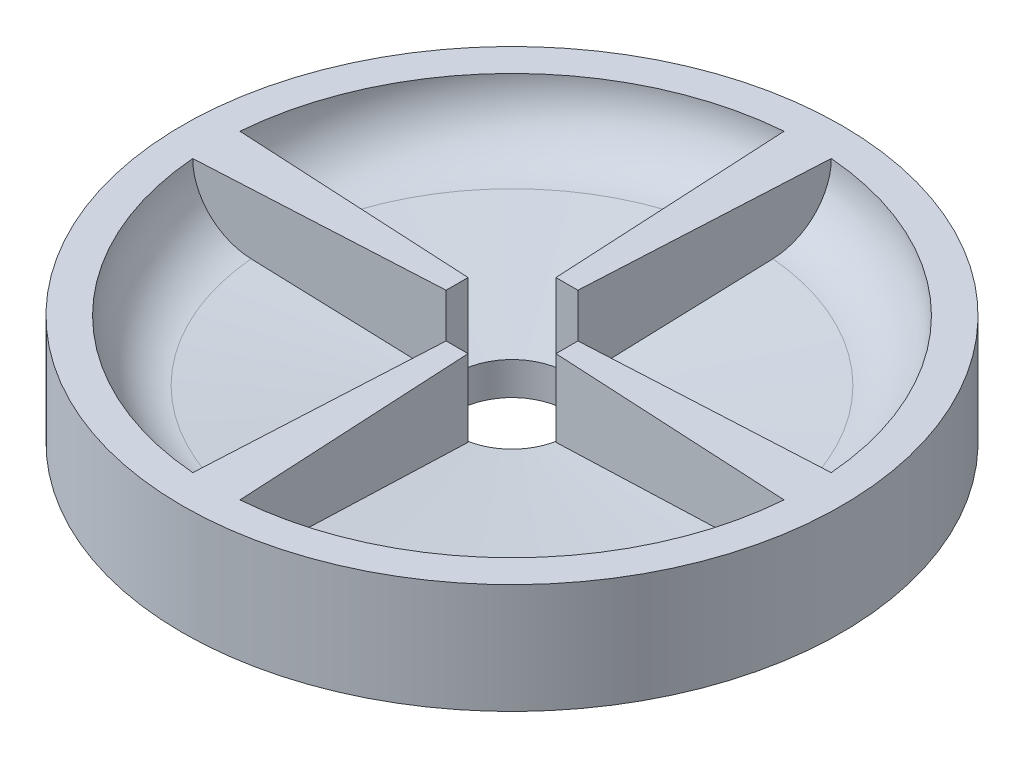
ISO-10303-21;
HEADER;
FILE_DESCRIPTION(('STEP AP214'),'2;1');
FILE_NAME('part.step','',(''),(''),'','','');
FILE_SCHEMA(('AUTOMOTIVE_DESIGN { 1 0 10303 214 1 1 1 1 }'));
ENDSEC;
DATA;
#1=APPLICATION_CONTEXT('core data for automotive mechanical design processes');
#2=APPLICATION_PROTOCOL_DEFINITION('international standard','automotive_design',2000,#1);
#3=PRODUCT_CONTEXT('',#1,'mechanical');
#4=PRODUCT('Part','Part','',(#3));
#5=PRODUCT_RELATED_PRODUCT_CATEGORY('part','',(#4));
#6=PRODUCT_DEFINITION_FORMATION('','',#4);
#7=PRODUCT_DEFINITION_CONTEXT('part definition',#1,'design');
#8=PRODUCT_DEFINITION('design','',#6,#7);
#9=PRODUCT_DEFINITION_SHAPE('','',#8);
#10=(LENGTH_UNIT() NAMED_UNIT(*) SI_UNIT(.MILLI.,.METRE.));
#11=(NAMED_UNIT(*) PLANE_ANGLE_UNIT() SI_UNIT($,.RADIAN.));
#12=(NAMED_UNIT(*) SI_UNIT($,.STERADIAN.) SOLID_ANGLE_UNIT());
#13=UNCERTAINTY_MEASURE_WITH_UNIT(LENGTH_MEASURE(1.E-05),#10,'distance_accuracy_value','');
#14=(GEOMETRIC_REPRESENTATION_CONTEXT(3) GLOBAL_UNCERTAINTY_ASSIGNED_CONTEXT((#13)) GLOBAL_UNIT_ASSIGNED_CONTEXT((#10,
#11,#12)) REPRESENTATION_CONTEXT('',''));
#15=CARTESIAN_POINT('',(0.,0.,0.));
#16=DIRECTION('',(0.,0.,1.));
#17=DIRECTION('',(1.,0.,0.));
#18=AXIS2_PLACEMENT_3D('',#15,#16,#17);
#19=CARTESIAN_POINT('',(0.,10.,0.));
#20=DIRECTION('',(0.,-1.,0.));
#21=DIRECTION('',(0.,0.,-1.));
#22=AXIS2_PLACEMENT_3D('',#19,#20,#21);
#23=TOROIDAL_SURFACE('',#22,21.4613371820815,5.53866281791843);
#24=CARTESIAN_POINT('',(0.,4.48241346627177,0.));
#25=DIRECTION('',(0.,-1.,0.));
#26=DIRECTION('',(0.,0.,-1.));
#27=AXIS2_PLACEMENT_3D('',#24,#25,#26);
#28=CIRCLE('',#27,21.944063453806);
#29=CARTESIAN_POINT('',(1.88375551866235,4.48241346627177,-21.8630598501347));
#30=VERTEX_POINT('',#29);
#31=CARTESIAN_POINT('',(21.8630598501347,4.48241346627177,-1.88375551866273));
#32=VERTEX_POINT('',#31);
#33=EDGE_CURVE('E59',#30,#32,#28,.T.);
#34=ORIENTED_EDGE('',*,*,#33,.T.);
#35=CARTESIAN_POINT('',(21.8607702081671,4.48221346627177,-1.88363552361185));
#36=CARTESIAN_POINT('',(22.015863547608,4.49571158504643,-1.89176362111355));
#37=CARTESIAN_POINT('',(22.1703826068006,4.51579181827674,-1.89986162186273));
#38=CARTESIAN_POINT('',(22.4771784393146,4.56890123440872,-1.91594011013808));
#39=CARTESIAN_POINT('',(22.6294553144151,4.60192982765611,-1.92392060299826));
#40=CARTESIAN_POINT('',(22.930583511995,4.68069478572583,-1.93970206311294));
#41=CARTESIAN_POINT('',(23.0794371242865,4.72642237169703,-1.94750315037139));
#42=CARTESIAN_POINT('',(23.3727685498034,4.83026573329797,-1.96287599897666));
#43=CARTESIAN_POINT('',(23.5172464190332,4.88838135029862,-1.97044776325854));
#44=CARTESIAN_POINT('',(23.8008466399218,5.01661172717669,-1.9853106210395));
#45=CARTESIAN_POINT('',(23.9399672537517,5.08673034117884,-1.99260162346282));
#46=CARTESIAN_POINT('',(24.2118640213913,5.23848422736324,-2.00685112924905));
#47=CARTESIAN_POINT('',(24.3446378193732,5.32012373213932,-2.01380950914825));
#48=CARTESIAN_POINT('',(24.6027625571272,5.49426783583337,-2.02733725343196));
#49=CARTESIAN_POINT('',(24.728117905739,5.58676588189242,-2.03390684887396));
#50=CARTESIAN_POINT('',(24.9706420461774,5.78204372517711,-2.04661700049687));
#51=CARTESIAN_POINT('',(25.0878079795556,5.8848270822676,-2.05275740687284));
#52=CARTESIAN_POINT('',(25.3130034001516,6.09985417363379,-2.06455939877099));
#53=CARTESIAN_POINT('',(25.4210382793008,6.21209224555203,-2.07022126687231));
#54=CARTESIAN_POINT('',(25.6272802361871,6.44528425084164,-2.08102994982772));
#55=CARTESIAN_POINT('',(25.725487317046,6.56623818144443,-2.0861767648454));
#56=CARTESIAN_POINT('',(25.9114273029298,6.8160737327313,-2.09592146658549));
#57=CARTESIAN_POINT('',(25.9991542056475,6.94495983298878,-2.1005190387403));
#58=CARTESIAN_POINT('',(26.163414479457,7.20963405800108,-2.10912755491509));
#59=CARTESIAN_POINT('',(26.2399517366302,7.34541976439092,-2.11313870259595));
#60=CARTESIAN_POINT('',(26.3813514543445,7.62302319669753,-2.12054914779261));
#61=CARTESIAN_POINT('',(26.4462092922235,7.76484328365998,-2.12394820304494));
#62=CARTESIAN_POINT('',(26.5637283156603,8.05340221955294,-2.13010711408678));
#63=CARTESIAN_POINT('',(26.6163940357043,8.20013921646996,-2.13286720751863));
#64=CARTESIAN_POINT('',(26.7091415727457,8.49739914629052,-2.13772789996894));
#65=CARTESIAN_POINT('',(26.7492348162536,8.64791850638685,-2.13982909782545));
#66=CARTESIAN_POINT('',(26.8166040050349,8.95174727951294,-2.14335976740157));
#67=CARTESIAN_POINT('',(26.8438854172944,9.10505547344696,-2.1447895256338));
#68=CARTESIAN_POINT('',(26.8812370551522,9.38209429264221,-2.14674704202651));
#69=CARTESIAN_POINT('',(26.8936771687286,9.50551011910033,-2.14739900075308));
#70=CARTESIAN_POINT('',(26.9102477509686,9.75268131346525,-2.1482674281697));
#71=CARTESIAN_POINT('',(26.9143928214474,9.87643570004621,-2.14848466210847));
#72=CARTESIAN_POINT('',(26.9143830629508,10.0002,-2.14848415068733));
#73=B_SPLINE_CURVE_WITH_KNOTS('',3,(#35,#36,#37,#38,#39,#40,#41,#42,#43,#44,#45,#46,#47,#48,#49,
#50,#51,#52,#53,#54,#55,#56,#57,#58,#59,#60,#61,#62,#63,#64,#65,#66,#67,#68,#69,#70,#71,#72),
.UNSPECIFIED.,.F.,.F.,(4,2,2,2,2,2,2,2,2,2,2,2,2,2,2,2,2,2,4),(0.,0.467532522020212,
0.935043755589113,1.40223259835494,1.8694154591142,2.33674861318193,2.80425390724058,
3.27147850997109,3.73886538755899,4.20597431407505,4.6730830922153,5.14045812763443,
5.6076704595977,6.07506730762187,6.54229004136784,7.00908690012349,7.47568438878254,
7.84754305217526,8.21874655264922),.UNSPECIFIED.);
#74=CARTESIAN_POINT('',(26.9143830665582,10.,-2.14848415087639));
#75=VERTEX_POINT('',#74);
#76=EDGE_CURVE('E435',#32,#75,#73,.T.);
#77=ORIENTED_EDGE('',*,*,#76,.T.);
#78=CARTESIAN_POINT('',(0.,10.,0.));
#79=DIRECTION('',(0.,-1.,0.));
#80=DIRECTION('',(0.,0.,-1.));
#81=AXIS2_PLACEMENT_3D('',#78,#79,#80);
#82=CIRCLE('',#81,27.);
#83=CARTESIAN_POINT('',(2.14848415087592,10.,-26.9143830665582));
#84=VERTEX_POINT('',#83);
#85=EDGE_CURVE('E51',#84,#75,#82,.T.);
#86=ORIENTED_EDGE('',*,*,#85,.F.);
#87=CARTESIAN_POINT('',(1.88363552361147,4.48221346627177,-21.8607702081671));
#88=CARTESIAN_POINT('',(1.89176362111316,4.49571158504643,-22.0158635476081));
#89=CARTESIAN_POINT('',(1.89986162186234,4.51579181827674,-22.1703826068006));
#90=CARTESIAN_POINT('',(1.91594011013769,4.56890123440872,-22.4771784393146));
#91=CARTESIAN_POINT('',(1.92392060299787,4.60192982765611,-22.6294553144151));
#92=CARTESIAN_POINT('',(1.93970206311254,4.68069478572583,-22.9305835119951));
#93=CARTESIAN_POINT('',(1.94750315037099,4.72642237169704,-23.0794371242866));
#94=CARTESIAN_POINT('',(1.96287599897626,4.83026573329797,-23.3727685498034));
#95=CARTESIAN_POINT('',(1.97044776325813,4.88838135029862,-23.5172464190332));
#96=CARTESIAN_POINT('',(1.98531062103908,5.01661172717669,-23.8008466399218));
#97=CARTESIAN_POINT('',(1.9926016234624,5.08673034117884,-23.9399672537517));
#98=CARTESIAN_POINT('',(2.00685112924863,5.23848422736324,-24.2118640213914));
#99=CARTESIAN_POINT('',(2.01380950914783,5.32012373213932,-24.3446378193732));
#100=CARTESIAN_POINT('',(2.02733725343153,5.49426783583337,-24.6027625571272));
#101=CARTESIAN_POINT('',(2.03390684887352,5.58676588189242,-24.728117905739));
#102=CARTESIAN_POINT('',(2.04661700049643,5.78204372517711,-24.9706420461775));
#103=CARTESIAN_POINT('',(2.05275740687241,5.8848270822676,-25.0878079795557));
#104=CARTESIAN_POINT('',(2.06455939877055,6.09985417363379,-25.3130034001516));
#105=CARTESIAN_POINT('',(2.07022126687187,6.21209224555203,-25.4210382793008));
#106=CARTESIAN_POINT('',(2.08102994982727,6.44528425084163,-25.6272802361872));
#107=CARTESIAN_POINT('',(2.08617676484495,6.56623818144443,-25.725487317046));
#108=CARTESIAN_POINT('',(2.09592146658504,6.8160737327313,-25.9114273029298));
#109=CARTESIAN_POINT('',(2.10051903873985,6.94495983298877,-25.9991542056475));
#110=CARTESIAN_POINT('',(2.10912755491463,7.20963405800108,-26.163414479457));
#111=CARTESIAN_POINT('',(2.11313870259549,7.34541976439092,-26.2399517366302));
#112=CARTESIAN_POINT('',(2.12054914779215,7.62302319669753,-26.3813514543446));
#113=CARTESIAN_POINT('',(2.12394820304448,7.76484328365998,-26.4462092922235));
#114=CARTESIAN_POINT('',(2.13010711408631,8.05340221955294,-26.5637283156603));
#115=CARTESIAN_POINT('',(2.13286720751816,8.20013921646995,-26.6163940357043));
#116=CARTESIAN_POINT('',(2.13772789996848,8.49739914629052,-26.7091415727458));
#117=CARTESIAN_POINT('',(2.13982909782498,8.64791850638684,-26.7492348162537));
#118=CARTESIAN_POINT('',(2.1433597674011,8.95174727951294,-26.8166040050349));
#119=CARTESIAN_POINT('',(2.14478952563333,9.10505547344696,-26.8438854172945));
#120=CARTESIAN_POINT('',(2.14674704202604,9.38209429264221,-26.8812370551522));
#121=CARTESIAN_POINT('',(2.14739900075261,9.50551011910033,-26.8936771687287));
#122=CARTESIAN_POINT('',(2.14826742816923,9.75268131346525,-26.9102477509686));
#123=CARTESIAN_POINT('',(2.148484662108,9.87643570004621,-26.9143928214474));
#124=CARTESIAN_POINT('',(2.14848415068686,10.0002,-26.9143830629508));
#125=B_SPLINE_CURVE_WITH_KNOTS('',3,(#87,#88,#89,#90,#91,#92,#93,#94,#95,#96,#97,#98,#99,#100,
#101,#102,#103,#104,#105,#106,#107,#108,#109,#110,#111,#112,#113,#114,#115,#116,#117,#118,#119,
#120,#121,#122,#123,#124),.UNSPECIFIED.,.F.,.F.,(4,2,2,2,2,2,2,2,2,2,2,2,2,2,2,2,2,2,4),(0.,
0.467532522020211,0.935043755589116,1.40223259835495,1.8694154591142,2.33674861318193,
2.80425390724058,3.27147850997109,3.73886538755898,4.20597431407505,4.67308309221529,
5.14045812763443,5.6076704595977,6.07506730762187,6.54229004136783,7.00908690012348,
7.47568438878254,7.84754305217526,8.21874655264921),.UNSPECIFIED.);
#126=EDGE_CURVE('E44',#30,#84,#125,.T.);
#127=ORIENTED_EDGE('',*,*,#126,.F.);
#128=EDGE_LOOP('',(#34,#77,#86,#127));
#129=FACE_BOUND('',#128,.T.);
#130=ADVANCED_FACE('F35',(#129),#23,.F.);
#131=CARTESIAN_POINT('',(0.,3.,0.));
#132=DIRECTION('',(0.,1.,0.));
#133=DIRECTION('',(0.,0.,1.));
#134=AXIS2_PLACEMENT_3D('',#131,#132,#133);
#135=CONICAL_SURFACE('',#134,5.,1.48352986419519);
#136=CARTESIAN_POINT('',(0.,3.,0.));
#137=DIRECTION('',(0.,-1.,0.));
#138=DIRECTION('',(0.,0.,-1.));
#139=AXIS2_PLACEMENT_3D('',#136,#137,#138);
#140=CIRCLE('',#139,5.);
#141=CARTESIAN_POINT('',(0.,3.,-5.));
#142=VERTEX_POINT('',#141);
#143=CARTESIAN_POINT('',(5.,3.,0.));
#144=VERTEX_POINT('',#143);
#145=EDGE_CURVE('E395',#142,#144,#140,.T.);
#146=ORIENTED_EDGE('',*,*,#145,.T.);
#147=CARTESIAN_POINT('',(5.00000000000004,3.21233240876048,5.4918021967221));
#148=CARTESIAN_POINT('',(5.00000000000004,3.19957344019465,5.29453235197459));
#149=CARTESIAN_POINT('',(5.00000000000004,3.18711856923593,5.09724281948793));
#150=CARTESIAN_POINT('',(5.00000000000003,3.16295243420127,4.70261628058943));
#151=CARTESIAN_POINT('',(5.00000000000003,3.1512411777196,4.5052792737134));
#152=CARTESIAN_POINT('',(5.00000000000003,3.11742197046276,3.91311451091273));
#153=CARTESIAN_POINT('',(5.00000000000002,3.09663362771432,3.51820939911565));
#154=CARTESIAN_POINT('',(5.00000000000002,3.06004190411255,2.72864501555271));
#155=CARTESIAN_POINT('',(5.00000000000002,3.04423246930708,2.33398603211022));
#156=CARTESIAN_POINT('',(5.00000000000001,3.01926578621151,1.54448486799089));
#157=CARTESIAN_POINT('',(5.00000000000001,3.01010791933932,1.14964270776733));
#158=CARTESIAN_POINT('',(5.,2.99980158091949,0.359711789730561));
#159=CARTESIAN_POINT('',(5.,2.99865587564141,-0.0353770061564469));
#160=CARTESIAN_POINT('',(5.,3.00458023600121,-0.825521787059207));
#161=CARTESIAN_POINT('',(4.99999999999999,3.01165095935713,-1.22057776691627));
#162=CARTESIAN_POINT('',(4.99999999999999,3.03289614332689,-2.01095073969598));
#163=CARTESIAN_POINT('',(4.99999999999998,3.04707893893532,-2.40626749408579));
#164=CARTESIAN_POINT('',(4.99999999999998,3.08088613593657,-3.19661460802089));
#165=CARTESIAN_POINT('',(4.99999999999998,3.10050974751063,-3.59164500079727));
#166=CARTESIAN_POINT('',(4.99999999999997,3.12202302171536,-3.9865480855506));
#167=B_SPLINE_CURVE_WITH_KNOTS('',3,(#147,#148,#149,#150,#151,#152,#153,#154,#155,#156,#157,
#158,#159,#160,#161,#162,#163,#164,#165,#166),.UNSPECIFIED.,.F.,.F.,(4,2,2,2,2,2,2,2,2,4),(0.,
0.593045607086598,1.1860972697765,2.37243024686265,3.55731511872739,4.74208978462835,
5.92727348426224,7.11255206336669,8.29922298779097,9.48572173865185),.UNSPECIFIED.);
#168=CARTESIAN_POINT('',(4.99999999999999,3.00866308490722,-1.00000000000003));
#169=VERTEX_POINT('',#168);
#170=EDGE_CURVE('E436',#144,#169,#167,.T.);
#171=ORIENTED_EDGE('',*,*,#170,.T.);
#172=CARTESIAN_POINT('',(-5.27420334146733,3.0257531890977,-0.461551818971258));
#173=CARTESIAN_POINT('',(-5.05576039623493,3.00680493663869,-0.472999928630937));
#174=CARTESIAN_POINT('',(-4.83731593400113,2.98787406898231,-0.48444811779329));
#175=CARTESIAN_POINT('',(-4.40040365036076,2.95007969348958,-0.507345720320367));
#176=CARTESIAN_POINT('',(-4.18193582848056,2.93121619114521,-0.518795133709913));
#177=CARTESIAN_POINT('',(-3.74452704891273,2.89355219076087,-0.541718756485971));
#178=CARTESIAN_POINT('',(-3.52558607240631,2.87475191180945,-0.553192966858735));
#179=CARTESIAN_POINT('',(-3.08770696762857,2.83732524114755,-0.576141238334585));
#180=CARTESIAN_POINT('',(-2.86876884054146,2.818698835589,-0.58761529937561));
#181=CARTESIAN_POINT('',(-2.54083705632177,2.79104762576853,-0.604801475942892));
#182=CARTESIAN_POINT('',(-2.43185380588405,2.78189916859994,-0.610513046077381));
#183=CARTESIAN_POINT('',(-2.21387698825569,2.76372213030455,-0.62193672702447));
#184=CARTESIAN_POINT('',(-2.10488342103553,2.75469354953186,-0.627648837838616));
#185=CARTESIAN_POINT('',(-1.88685343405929,2.73681407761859,-0.639075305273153));
#186=CARTESIAN_POINT('',(-1.7778170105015,2.72796323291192,-0.644789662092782));
#187=CARTESIAN_POINT('',(-1.55972244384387,2.71054759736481,-0.656219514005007));
#188=CARTESIAN_POINT('',(-1.45066430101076,2.70198280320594,-0.661935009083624));
#189=CARTESIAN_POINT('',(-1.232657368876,2.68535188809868,-0.673360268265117));
#190=CARTESIAN_POINT('',(-1.12370862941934,2.67728511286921,-0.679070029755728));
#191=CARTESIAN_POINT('',(-0.9057385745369,2.66203008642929,-0.690493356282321));
#192=CARTESIAN_POINT('',(-0.796717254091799,2.65484190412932,-0.696206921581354));
#193=CARTESIAN_POINT('',(-0.633136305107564,2.64536847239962,-0.704779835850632));
#194=CARTESIAN_POINT('',(-0.578615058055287,2.64242938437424,-0.707637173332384));
#195=CARTESIAN_POINT('',(-0.469541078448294,2.63716641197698,-0.713353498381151));
#196=CARTESIAN_POINT('',(-0.414988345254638,2.63484254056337,-0.716212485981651));
#197=CARTESIAN_POINT('',(-0.305867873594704,2.63101316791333,-0.721931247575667));
#198=CARTESIAN_POINT('',(-0.251300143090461,2.62950744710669,-0.72479102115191));
#199=CARTESIAN_POINT('',(-0.142151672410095,2.62749951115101,-0.730511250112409));
#200=CARTESIAN_POINT('',(-0.0875709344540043,2.62699718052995,-0.733371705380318));
#201=CARTESIAN_POINT('',(0.0214698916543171,2.62706930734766,-0.739086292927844));
#202=CARTESIAN_POINT('',(0.0759299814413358,2.62764140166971,-0.741940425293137));
#203=CARTESIAN_POINT('',(0.184831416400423,2.62977580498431,-0.74764770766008));
#204=CARTESIAN_POINT('',(0.23927276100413,2.6313381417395,-0.750500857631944));
#205=CARTESIAN_POINT('',(0.402570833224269,2.63721897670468,-0.759058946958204));
#206=CARTESIAN_POINT('',(0.511383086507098,2.64273117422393,-0.764761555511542));
#207=CARTESIAN_POINT('',(0.728975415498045,2.65544494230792,-0.776165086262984));
#208=CARTESIAN_POINT('',(0.837755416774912,2.66264767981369,-0.781866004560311));
#209=CARTESIAN_POINT('',(1.05524471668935,2.67791678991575,-0.793264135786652));
#210=CARTESIAN_POINT('',(1.16395402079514,2.68598308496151,-0.798961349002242));
#211=CARTESIAN_POINT('',(1.38152586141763,2.70260621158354,-0.810363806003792));
#212=CARTESIAN_POINT('',(1.49038833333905,2.71116387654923,-0.816069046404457));
#213=CARTESIAN_POINT('',(1.7080926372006,2.72856252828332,-0.827478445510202));
#214=CARTESIAN_POINT('',(1.81693446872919,2.73740352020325,-0.833182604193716));
#215=CARTESIAN_POINT('',(2.1433580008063,2.764179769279,-0.850289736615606));
#216=CARTESIAN_POINT('',(2.3609183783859,2.78237465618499,-0.861691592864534));
#217=CARTESIAN_POINT('',(2.79670117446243,2.81913300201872,-0.884530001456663));
#218=CARTESIAN_POINT('',(3.01492350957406,2.83769744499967,-0.895966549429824));
#219=CARTESIAN_POINT('',(3.45137448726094,2.87500200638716,-0.918839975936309));
#220=CARTESIAN_POINT('',(3.66960312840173,2.89374214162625,-0.930276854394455));
#221=CARTESIAN_POINT('',(4.10589037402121,2.93131095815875,-0.95314170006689));
#222=CARTESIAN_POINT('',(4.32394898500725,2.95013956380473,-0.964569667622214));
#223=CARTESIAN_POINT('',(4.76005479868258,2.98786264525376,-0.987425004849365));
#224=CARTESIAN_POINT('',(4.97810200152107,3.00675711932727,-0.998852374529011));
#225=CARTESIAN_POINT('',(5.63408348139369,3.0636664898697,-1.03323090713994));
#226=CARTESIAN_POINT('',(6.07201199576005,3.10174796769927,-1.05618176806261));
#227=CARTESIAN_POINT('',(6.94794457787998,3.17800826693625,-1.10208744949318));
#228=CARTESIAN_POINT('',(7.38594864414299,3.21618710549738,-1.12504226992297));
#229=CARTESIAN_POINT('',(8.26144028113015,3.29255399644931,-1.17092484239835));
#230=CARTESIAN_POINT('',(8.69892785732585,3.33074198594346,-1.19385259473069));
#231=CARTESIAN_POINT('',(9.57387767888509,3.40714992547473,-1.23970677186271));
#232=CARTESIAN_POINT('',(10.0113399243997,3.44536987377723,-1.2626331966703));
#233=CARTESIAN_POINT('',(10.8882534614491,3.52200670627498,-1.30859028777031));
#234=CARTESIAN_POINT('',(11.3277047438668,3.56042369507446,-1.33162095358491));
#235=CARTESIAN_POINT('',(12.206611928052,3.63727447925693,-1.37768252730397));
#236=CARTESIAN_POINT('',(12.6460678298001,3.67570827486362,-1.40071343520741));
#237=CARTESIAN_POINT('',(13.5251057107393,3.75259887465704,-1.44678185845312));
#238=CARTESIAN_POINT('',(13.9646876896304,3.79105568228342,-1.46981937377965));
#239=CARTESIAN_POINT('',(14.8438492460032,3.86797812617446,-1.51589427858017));
#240=CARTESIAN_POINT('',(15.2834288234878,3.90644376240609,-1.53893166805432));
#241=CARTESIAN_POINT('',(16.6008601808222,4.0217365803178,-1.60797531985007));
#242=CARTESIAN_POINT('',(17.4787110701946,4.09857396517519,-1.65398153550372));
#243=CARTESIAN_POINT('',(19.2343473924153,4.25226015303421,-1.74599053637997));
#244=CARTESIAN_POINT('',(20.1121328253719,4.32910895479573,-1.79199332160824));
#245=CARTESIAN_POINT('',(21.4586215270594,4.44700096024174,-1.86255980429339));
#246=CARTESIAN_POINT('',(21.9273251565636,4.48804003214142,-1.88712352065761));
#247=CARTESIAN_POINT('',(22.8647391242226,4.57012152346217,-1.93625130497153));
#248=CARTESIAN_POINT('',(23.3334494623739,4.61116394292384,-1.96081537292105));
#249=CARTESIAN_POINT('',(24.2710341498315,4.693265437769,-2.00995210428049));
#250=CARTESIAN_POINT('',(24.739908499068,4.73432451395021,-2.03452476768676));
#251=CARTESIAN_POINT('',(25.6776551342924,4.81644442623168,-2.08366998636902));
#252=CARTESIAN_POINT('',(26.146527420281,4.85750526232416,-2.10824254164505));
#253=CARTESIAN_POINT('',(27.5493769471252,4.98036029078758,-2.18176277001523));
#254=CARTESIAN_POINT('',(28.4833539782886,5.06215688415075,-2.23071043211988));
#255=CARTESIAN_POINT('',(30.3509763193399,5.22572591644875,-2.32858837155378));
#256=CARTESIAN_POINT('',(31.2846216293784,5.30749835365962,-2.37751864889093));
#257=CARTESIAN_POINT('',(32.2182667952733,5.38927244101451,-2.42644891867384));
#258=B_SPLINE_CURVE_WITH_KNOTS('',3,(#172,#173,#174,#175,#176,#177,#178,#179,#180,#181,#182,
#183,#184,#185,#186,#187,#188,#189,#190,#191,#192,#193,#194,#195,#196,#197,#198,#199,#200,#201,
#202,#203,#204,#205,#206,#207,#208,#209,#210,#211,#212,#213,#214,#215,#216,#217,#218,#219,#220,
#221,#222,#223,#224,#225,#226,#227,#228,#229,#230,#231,#232,#233,#234,#235,#236,#237,#238,#239,
#240,#241,#242,#243,#244,#245,#246,#247,#248,#249,#250,#251,#252,#253,#254,#255,#256,#257),
.UNSPECIFIED.,.F.,.F.,(4,2,2,2,2,2,2,2,2,2,2,2,2,2,2,2,2,2,2,2,2,2,2,2,2,2,2,2,2,2,2,2,2,2,2,2,
2,2,2,2,2,2,4),(0.,0.658685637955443,1.31742380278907,1.97756189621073,2.63764695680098,
2.96619369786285,3.29474140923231,3.62337386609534,3.95200250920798,4.28018979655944,
4.60840280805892,4.77242575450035,4.93645215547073,5.10043451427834,5.26439800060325,
5.42800128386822,5.59160915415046,5.91888048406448,6.24637838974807,6.57384690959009,
6.90188825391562,7.22993556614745,7.88578719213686,8.54371403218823,9.20170456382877,
9.85920896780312,10.5166962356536,11.8372358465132,13.158026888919,14.4772745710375,
15.7964547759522,17.1216390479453,18.4468415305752,19.7724273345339,21.0980082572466,
23.7452303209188,26.3922594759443,27.8056723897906,29.2191062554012,30.6330353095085,
32.04695864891,34.8634452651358,37.6789328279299),.UNSPECIFIED.);
#259=EDGE_CURVE('E331',#169,#32,#258,.T.);
#260=ORIENTED_EDGE('',*,*,#259,.T.);
#261=ORIENTED_EDGE('',*,*,#33,.F.);
#262=CARTESIAN_POINT('',(0.46155181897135,3.0257531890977,5.27420334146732));
#263=CARTESIAN_POINT('',(0.472999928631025,3.00680493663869,5.05576039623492));
#264=CARTESIAN_POINT('',(0.484448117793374,2.98787406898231,4.83731593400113));
#265=CARTESIAN_POINT('',(0.507345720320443,2.95007969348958,4.40040365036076));
#266=CARTESIAN_POINT('',(0.518795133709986,2.93121619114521,4.18193582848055));
#267=CARTESIAN_POINT('',(0.541718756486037,2.89355219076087,3.74452704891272));
#268=CARTESIAN_POINT('',(0.553192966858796,2.87475191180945,3.5255860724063));
#269=CARTESIAN_POINT('',(0.576141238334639,2.83732524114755,3.08770696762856));
#270=CARTESIAN_POINT('',(0.58761529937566,2.818698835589,2.86876884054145));
#271=CARTESIAN_POINT('',(0.604801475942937,2.79104762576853,2.54083705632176));
#272=CARTESIAN_POINT('',(0.610513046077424,2.78189916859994,2.43185380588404));
#273=CARTESIAN_POINT('',(0.621936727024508,2.76372213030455,2.21387698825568));
#274=CARTESIAN_POINT('',(0.627648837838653,2.75469354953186,2.10488342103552));
#275=CARTESIAN_POINT('',(0.639075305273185,2.73681407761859,1.88685343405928));
#276=CARTESIAN_POINT('',(0.644789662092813,2.72796323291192,1.77781701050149));
#277=CARTESIAN_POINT('',(0.656219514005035,2.71054759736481,1.55972244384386));
#278=CARTESIAN_POINT('',(0.661935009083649,2.70198280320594,1.45066430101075));
#279=CARTESIAN_POINT('',(0.673360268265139,2.68535188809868,1.23265736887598));
#280=CARTESIAN_POINT('',(0.679070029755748,2.67728511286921,1.12370862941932));
#281=CARTESIAN_POINT('',(0.690493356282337,2.66203008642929,0.905738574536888));
#282=CARTESIAN_POINT('',(0.696206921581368,2.65484190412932,0.796717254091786));
#283=CARTESIAN_POINT('',(0.704779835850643,2.64536847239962,0.633136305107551));
#284=CARTESIAN_POINT('',(0.707637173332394,2.64242938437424,0.578615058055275));
#285=CARTESIAN_POINT('',(0.713353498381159,2.63716641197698,0.469541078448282));
#286=CARTESIAN_POINT('',(0.716212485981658,2.63484254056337,0.414988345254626));
#287=CARTESIAN_POINT('',(0.721931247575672,2.63101316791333,0.305867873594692));
#288=CARTESIAN_POINT('',(0.724791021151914,2.62950744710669,0.251300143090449));
#289=CARTESIAN_POINT('',(0.730511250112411,2.62749951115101,0.142151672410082));
#290=CARTESIAN_POINT('',(0.733371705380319,2.62699718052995,0.0875709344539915));
#291=CARTESIAN_POINT('',(0.739086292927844,2.62706930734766,-0.02146989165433));
#292=CARTESIAN_POINT('',(0.741940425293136,2.62764140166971,-0.0759299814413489));
#293=CARTESIAN_POINT('',(0.747647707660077,2.62977580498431,-0.184831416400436));
#294=CARTESIAN_POINT('',(0.750500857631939,2.6313381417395,-0.239272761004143));
#295=CARTESIAN_POINT('',(0.759058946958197,2.63721897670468,-0.402570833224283));
#296=CARTESIAN_POINT('',(0.764761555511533,2.64273117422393,-0.511383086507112));
#297=CARTESIAN_POINT('',(0.776165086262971,2.65544494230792,-0.728975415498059));
#298=CARTESIAN_POINT('',(0.781866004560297,2.66264767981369,-0.837755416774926));
#299=CARTESIAN_POINT('',(0.793264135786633,2.67791678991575,-1.05524471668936));
#300=CARTESIAN_POINT('',(0.798961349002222,2.68598308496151,-1.16395402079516));
#301=CARTESIAN_POINT('',(0.810363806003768,2.70260621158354,-1.38152586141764));
#302=CARTESIAN_POINT('',(0.816069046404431,2.71116387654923,-1.49038833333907));
#303=CARTESIAN_POINT('',(0.827478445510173,2.72856252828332,-1.70809263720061));
#304=CARTESIAN_POINT('',(0.833182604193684,2.73740352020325,-1.81693446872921));
#305=CARTESIAN_POINT('',(0.850289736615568,2.764179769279,-2.14335800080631));
#306=CARTESIAN_POINT('',(0.861691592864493,2.78237465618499,-2.36091837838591));
#307=CARTESIAN_POINT('',(0.884530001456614,2.81913300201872,-2.79670117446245));
#308=CARTESIAN_POINT('',(0.895966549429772,2.83769744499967,-3.01492350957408));
#309=CARTESIAN_POINT('',(0.918839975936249,2.87500200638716,-3.45137448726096));
#310=CARTESIAN_POINT('',(0.930276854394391,2.89374214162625,-3.66960312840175));
#311=CARTESIAN_POINT('',(0.953141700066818,2.93131095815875,-4.10589037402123));
#312=CARTESIAN_POINT('',(0.964569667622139,2.95013956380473,-4.32394898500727));
#313=CARTESIAN_POINT('',(0.987425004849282,2.98786264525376,-4.7600547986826));
#314=CARTESIAN_POINT('',(0.998852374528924,3.00675711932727,-4.97810200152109));
#315=CARTESIAN_POINT('',(1.03323090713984,3.0636664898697,-5.6340834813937));
#316=CARTESIAN_POINT('',(1.0561817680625,3.10174796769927,-6.07201199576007));
#317=CARTESIAN_POINT('',(1.10208744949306,3.17800826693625,-6.94794457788));
#318=CARTESIAN_POINT('',(1.12504226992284,3.21618710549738,-7.38594864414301));
#319=CARTESIAN_POINT('',(1.1709248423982,3.29255399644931,-8.26144028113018));
#320=CARTESIAN_POINT('',(1.19385259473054,3.33074198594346,-8.69892785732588));
#321=CARTESIAN_POINT('',(1.23970677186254,3.40714992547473,-9.57387767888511));
#322=CARTESIAN_POINT('',(1.26263319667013,3.44536987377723,-10.0113399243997));
#323=CARTESIAN_POINT('',(1.30859028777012,3.52200670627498,-10.8882534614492));
#324=CARTESIAN_POINT('',(1.33162095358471,3.56042369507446,-11.3277047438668));
#325=CARTESIAN_POINT('',(1.37768252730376,3.63727447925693,-12.2066119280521));
#326=CARTESIAN_POINT('',(1.40071343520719,3.67570827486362,-12.6460678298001));
#327=CARTESIAN_POINT('',(1.44678185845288,3.75259887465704,-13.5251057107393));
#328=CARTESIAN_POINT('',(1.4698193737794,3.79105568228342,-13.9646876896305));
#329=CARTESIAN_POINT('',(1.51589427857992,3.86797812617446,-14.8438492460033));
#330=CARTESIAN_POINT('',(1.53893166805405,3.90644376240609,-15.2834288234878));
#331=CARTESIAN_POINT('',(1.60797531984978,4.0217365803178,-16.6008601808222));
#332=CARTESIAN_POINT('',(1.65398153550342,4.09857396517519,-17.4787110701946));
#333=CARTESIAN_POINT('',(1.74599053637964,4.25226015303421,-19.2343473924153));
#334=CARTESIAN_POINT('',(1.79199332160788,4.32910895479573,-20.1121328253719));
#335=CARTESIAN_POINT('',(1.86255980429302,4.44700096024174,-21.4586215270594));
#336=CARTESIAN_POINT('',(1.88712352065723,4.48804003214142,-21.9273251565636));
#337=CARTESIAN_POINT('',(1.93625130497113,4.57012152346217,-22.8647391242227));
#338=CARTESIAN_POINT('',(1.96081537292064,4.61116394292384,-23.333449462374));
#339=CARTESIAN_POINT('',(2.00995210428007,4.693265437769,-24.2710341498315));
#340=CARTESIAN_POINT('',(2.03452476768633,4.73432451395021,-24.739908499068));
#341=CARTESIAN_POINT('',(2.08366998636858,4.81644442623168,-25.6776551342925));
#342=CARTESIAN_POINT('',(2.10824254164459,4.85750526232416,-26.146527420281));
#343=CARTESIAN_POINT('',(2.18176277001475,4.98036029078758,-27.5493769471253));
#344=CARTESIAN_POINT('',(2.23071043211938,5.06215688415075,-28.4833539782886));
#345=CARTESIAN_POINT('',(2.32858837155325,5.22572591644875,-30.3509763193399));
#346=CARTESIAN_POINT('',(2.37751864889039,5.30749835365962,-31.2846216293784));
#347=CARTESIAN_POINT('',(2.42644891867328,5.38927244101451,-32.2182667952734));
#348=B_SPLINE_CURVE_WITH_KNOTS('',3,(#262,#263,#264,#265,#266,#267,#268,#269,#270,#271,#272,
#273,#274,#275,#276,#277,#278,#279,#280,#281,#282,#283,#284,#285,#286,#287,#288,#289,#290,#291,
#292,#293,#294,#295,#296,#297,#298,#299,#300,#301,#302,#303,#304,#305,#306,#307,#308,#309,#310,
#311,#312,#313,#314,#315,#316,#317,#318,#319,#320,#321,#322,#323,#324,#325,#326,#327,#328,#329,
#330,#331,#332,#333,#334,#335,#336,#337,#338,#339,#340,#341,#342,#343,#344,#345,#346,#347),
.UNSPECIFIED.,.F.,.F.,(4,2,2,2,2,2,2,2,2,2,2,2,2,2,2,2,2,2,2,2,2,2,2,2,2,2,2,2,2,2,2,2,2,2,2,2,
2,2,2,2,2,2,4),(0.,0.658685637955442,1.31742380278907,1.97756189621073,2.63764695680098,
2.96619369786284,3.29474140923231,3.62337386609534,3.95200250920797,4.28018979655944,
4.60840280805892,4.77242575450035,4.93645215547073,5.10043451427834,5.26439800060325,
5.42800128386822,5.59160915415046,5.91888048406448,6.24637838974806,6.57384690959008,
6.90188825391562,7.22993556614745,7.88578719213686,8.54371403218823,9.20170456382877,
9.85920896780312,10.5166962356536,11.8372358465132,13.158026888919,14.4772745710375,
15.7964547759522,17.1216390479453,18.4468415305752,19.7724273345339,21.0980082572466,
23.7452303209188,26.3922594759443,27.8056723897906,29.2191062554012,30.6330353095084,
32.04695864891,34.8634452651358,37.6789328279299),.UNSPECIFIED.);
#349=CARTESIAN_POINT('',(0.999999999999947,3.00866308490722,-5.00000000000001));
#350=VERTEX_POINT('',#349);
#351=EDGE_CURVE('E463',#350,#30,#348,.T.);
#352=ORIENTED_EDGE('',*,*,#351,.F.);
#353=CARTESIAN_POINT('',(5.49180219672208,3.21233240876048,-5.00000000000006));
#354=CARTESIAN_POINT('',(5.29453235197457,3.19957344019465,-5.00000000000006));
#355=CARTESIAN_POINT('',(5.09724281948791,3.18711856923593,-5.00000000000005));
#356=CARTESIAN_POINT('',(4.70261628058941,3.16295243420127,-5.00000000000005));
#357=CARTESIAN_POINT('',(4.50527927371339,3.1512411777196,-5.00000000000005));
#358=CARTESIAN_POINT('',(3.91311451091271,3.11742197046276,-5.00000000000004));
#359=CARTESIAN_POINT('',(3.51820939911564,3.09663362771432,-5.00000000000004));
#360=CARTESIAN_POINT('',(2.72864501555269,3.06004190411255,-5.00000000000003));
#361=CARTESIAN_POINT('',(2.3339860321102,3.04423246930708,-5.00000000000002));
#362=CARTESIAN_POINT('',(1.54448486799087,3.01926578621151,-5.00000000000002));
#363=CARTESIAN_POINT('',(1.14964270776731,3.01010791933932,-5.00000000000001));
#364=CARTESIAN_POINT('',(0.359711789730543,2.99980158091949,-5.));
#365=CARTESIAN_POINT('',(-0.0353770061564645,2.99865587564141,-5.));
#366=CARTESIAN_POINT('',(-0.825521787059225,3.00458023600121,-4.99999999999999));
#367=CARTESIAN_POINT('',(-1.22057776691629,3.01165095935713,-4.99999999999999));
#368=CARTESIAN_POINT('',(-2.010950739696,3.03289614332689,-4.99999999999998));
#369=CARTESIAN_POINT('',(-2.40626749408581,3.04707893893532,-4.99999999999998));
#370=CARTESIAN_POINT('',(-3.19661460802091,3.08088613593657,-4.99999999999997));
#371=CARTESIAN_POINT('',(-3.59164500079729,3.10050974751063,-4.99999999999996));
#372=CARTESIAN_POINT('',(-3.98654808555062,3.12202302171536,-4.99999999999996));
#373=B_SPLINE_CURVE_WITH_KNOTS('',3,(#353,#354,#355,#356,#357,#358,#359,#360,#361,#362,#363,
#364,#365,#366,#367,#368,#369,#370,#371,#372),.UNSPECIFIED.,.F.,.F.,(4,2,2,2,2,2,2,2,2,4),(0.,
0.593045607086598,1.1860972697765,2.37243024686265,3.55731511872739,4.74208978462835,
5.92727348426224,7.11255206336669,8.29922298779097,9.48572173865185),.UNSPECIFIED.);
#374=EDGE_CURVE('E363',#350,#142,#373,.T.);
#375=ORIENTED_EDGE('',*,*,#374,.T.);
#376=EDGE_LOOP('',(#146,#171,#260,#261,#352,#375));
#377=FACE_BOUND('',#376,.T.);
#378=ADVANCED_FACE('F235',(#377),#135,.F.);
#379=CARTESIAN_POINT('',(0.999999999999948,5.,-5.00000000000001));
#380=DIRECTION('',(-0.998629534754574,0.,-0.0523359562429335));
#381=DIRECTION('',(-0.0523359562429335,0.,0.998629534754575));
#382=AXIS2_PLACEMENT_3D('',#379,#380,#381);
#383=PLANE('',#382);
#384=DIRECTION('',(0.,-1.,0.));
#385=VECTOR('',#384,1.);
#386=CARTESIAN_POINT('',(0.999999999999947,3.,-5.00000000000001));
#387=LINE('',#386,#385);
#388=CARTESIAN_POINT('',(0.999999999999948,10.,-5.00000000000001));
#389=VERTEX_POINT('',#388);
#390=EDGE_CURVE('E370',#350,#389,#387,.F.);
#391=ORIENTED_EDGE('',*,*,#390,.F.);
#392=ORIENTED_EDGE('',*,*,#351,.T.);
#393=ORIENTED_EDGE('',*,*,#126,.T.);
#394=DIRECTION('',(-0.0523359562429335,0.,0.998629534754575));
#395=VECTOR('',#394,1.);
#396=CARTESIAN_POINT('',(0.997260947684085,10.,-4.94773576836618));
#397=LINE('',#396,#395);
#398=EDGE_CURVE('E11',#389,#84,#397,.F.);
#399=ORIENTED_EDGE('',*,*,#398,.F.);
#400=EDGE_LOOP('',(#391,#392,#393,#399));
#401=FACE_BOUND('',#400,.T.);
#402=ADVANCED_FACE('F37',(#401),#383,.F.);
#403=CARTESIAN_POINT('',(0.,3.,-5.));
#404=DIRECTION('',(0.,0.,1.));
#405=DIRECTION('',(0.,1.,0.));
#406=AXIS2_PLACEMENT_3D('',#403,#404,#405);
#407=PLANE('',#406);
#408=ORIENTED_EDGE('',*,*,#374,.F.);
#409=ORIENTED_EDGE('',*,*,#390,.T.);
#410=DIRECTION('',(-1.,0.,0.));
#411=VECTOR('',#410,1.);
#412=CARTESIAN_POINT('',(0.,10.,-5.));
#413=LINE('',#412,#411);
#414=CARTESIAN_POINT('',(-1.00000000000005,10.,-4.99999999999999));
#415=VERTEX_POINT('',#414);
#416=EDGE_CURVE('E462',#389,#415,#413,.T.);
#417=ORIENTED_EDGE('',*,*,#416,.T.);
#418=DIRECTION('',(0.,1.,0.));
#419=VECTOR('',#418,1.);
#420=CARTESIAN_POINT('',(-1.00000000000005,5.,-4.99999999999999));
#421=LINE('',#420,#419);
#422=CARTESIAN_POINT('',(-1.00000000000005,3.00866308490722,-4.99999999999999));
#423=VERTEX_POINT('',#422);
#424=EDGE_CURVE('E452',#423,#415,#421,.T.);
#425=ORIENTED_EDGE('',*,*,#424,.F.);
#426=EDGE_CURVE('E372',#142,#423,#373,.T.);
#427=ORIENTED_EDGE('',*,*,#426,.F.);
#428=EDGE_LOOP('',(#408,#409,#417,#425,#427));
#429=FACE_BOUND('',#428,.T.);
#430=ADVANCED_FACE('F251',(#429),#407,.T.);
#431=CARTESIAN_POINT('',(-1.00000000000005,5.,-4.99999999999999));
#432=DIRECTION('',(-0.998629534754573,0.,0.0523359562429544));
#433=DIRECTION('',(0.0523359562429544,0.,0.998629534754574));
#434=AXIS2_PLACEMENT_3D('',#431,#432,#433);
#435=PLANE('',#434);
#436=CARTESIAN_POINT('',(-0.46155181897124,3.0257531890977,5.27420334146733));
#437=CARTESIAN_POINT('',(-0.472999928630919,3.00680493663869,5.05576039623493));
#438=CARTESIAN_POINT('',(-0.484448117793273,2.98787406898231,4.83731593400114));
#439=CARTESIAN_POINT('',(-0.507345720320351,2.95007969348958,4.40040365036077));
#440=CARTESIAN_POINT('',(-0.518795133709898,2.93121619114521,4.18193582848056));
#441=CARTESIAN_POINT('',(-0.541718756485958,2.89355219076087,3.74452704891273));
#442=CARTESIAN_POINT('',(-0.553192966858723,2.87475191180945,3.52558607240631));
#443=CARTESIAN_POINT('',(-0.576141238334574,2.83732524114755,3.08770696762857));
#444=CARTESIAN_POINT('',(-0.5876152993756,2.818698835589,2.86876884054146));
#445=CARTESIAN_POINT('',(-0.604801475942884,2.79104762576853,2.54083705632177));
#446=CARTESIAN_POINT('',(-0.610513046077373,2.78189916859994,2.43185380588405));
#447=CARTESIAN_POINT('',(-0.621936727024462,2.76372213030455,2.21387698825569));
#448=CARTESIAN_POINT('',(-0.627648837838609,2.75469354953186,2.10488342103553));
#449=CARTESIAN_POINT('',(-0.639075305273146,2.73681407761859,1.88685343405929));
#450=CARTESIAN_POINT('',(-0.644789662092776,2.72796323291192,1.7778170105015));
#451=CARTESIAN_POINT('',(-0.656219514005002,2.71054759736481,1.55972244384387));
#452=CARTESIAN_POINT('',(-0.661935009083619,2.70198280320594,1.45066430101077));
#453=CARTESIAN_POINT('',(-0.673360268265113,2.68535188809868,1.232657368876));
#454=CARTESIAN_POINT('',(-0.679070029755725,2.67728511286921,1.12370862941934));
#455=CARTESIAN_POINT('',(-0.690493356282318,2.66203008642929,0.905738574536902));
#456=CARTESIAN_POINT('',(-0.696206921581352,2.65484190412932,0.796717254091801));
#457=CARTESIAN_POINT('',(-0.70477983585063,2.64536847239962,0.633136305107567));
#458=CARTESIAN_POINT('',(-0.707637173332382,2.64242938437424,0.57861505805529));
#459=CARTESIAN_POINT('',(-0.713353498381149,2.63716641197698,0.469541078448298));
#460=CARTESIAN_POINT('',(-0.71621248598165,2.63484254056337,0.414988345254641));
#461=CARTESIAN_POINT('',(-0.721931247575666,2.63101316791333,0.305867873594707));
#462=CARTESIAN_POINT('',(-0.72479102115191,2.62950744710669,0.251300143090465));
#463=CARTESIAN_POINT('',(-0.730511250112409,2.62749951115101,0.142151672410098));
#464=CARTESIAN_POINT('',(-0.733371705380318,2.62699718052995,0.0875709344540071));
#465=CARTESIAN_POINT('',(-0.739086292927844,2.62706930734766,-0.0214698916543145));
#466=CARTESIAN_POINT('',(-0.741940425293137,2.62764140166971,-0.0759299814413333));
#467=CARTESIAN_POINT('',(-0.747647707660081,2.62977580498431,-0.184831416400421));
#468=CARTESIAN_POINT('',(-0.750500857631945,2.6313381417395,-0.239272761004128));
#469=CARTESIAN_POINT('',(-0.759058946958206,2.63721897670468,-0.402570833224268));
#470=CARTESIAN_POINT('',(-0.764761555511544,2.64273117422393,-0.511383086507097));
#471=CARTESIAN_POINT('',(-0.776165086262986,2.65544494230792,-0.728975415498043));
#472=CARTESIAN_POINT('',(-0.781866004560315,2.66264767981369,-0.837755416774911));
#473=CARTESIAN_POINT('',(-0.793264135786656,2.67791678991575,-1.05524471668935));
#474=CARTESIAN_POINT('',(-0.798961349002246,2.68598308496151,-1.16395402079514));
#475=CARTESIAN_POINT('',(-0.810363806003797,2.70260621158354,-1.38152586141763));
#476=CARTESIAN_POINT('',(-0.816069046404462,2.71116387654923,-1.49038833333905));
#477=CARTESIAN_POINT('',(-0.827478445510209,2.72856252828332,-1.7080926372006));
#478=CARTESIAN_POINT('',(-0.833182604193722,2.73740352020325,-1.81693446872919));
#479=CARTESIAN_POINT('',(-0.850289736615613,2.764179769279,-2.14335800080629));
#480=CARTESIAN_POINT('',(-0.861691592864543,2.78237465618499,-2.3609183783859));
#481=CARTESIAN_POINT('',(-0.884530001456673,2.81913300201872,-2.79670117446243));
#482=CARTESIAN_POINT('',(-0.895966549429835,2.83769744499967,-3.01492350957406));
#483=CARTESIAN_POINT('',(-0.918839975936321,2.87500200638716,-3.45137448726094));
#484=CARTESIAN_POINT('',(-0.930276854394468,2.89374214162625,-3.66960312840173));
#485=CARTESIAN_POINT('',(-0.953141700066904,2.93131095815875,-4.10589037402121));
#486=CARTESIAN_POINT('',(-0.96456966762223,2.95013956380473,-4.32394898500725));
#487=CARTESIAN_POINT('',(-0.987425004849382,2.98786264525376,-4.76005479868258));
#488=CARTESIAN_POINT('',(-0.998852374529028,3.00675711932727,-4.97810200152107));
#489=CARTESIAN_POINT('',(-1.03323090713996,3.0636664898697,-5.63408348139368));
#490=CARTESIAN_POINT('',(-1.05618176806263,3.10174796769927,-6.07201199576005));
#491=CARTESIAN_POINT('',(-1.1020874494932,3.17800826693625,-6.94794457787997));
#492=CARTESIAN_POINT('',(-1.125042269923,3.21618710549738,-7.38594864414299));
#493=CARTESIAN_POINT('',(-1.17092484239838,3.29255399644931,-8.26144028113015));
#494=CARTESIAN_POINT('',(-1.19385259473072,3.33074198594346,-8.69892785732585));
#495=CARTESIAN_POINT('',(-1.23970677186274,3.40714992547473,-9.57387767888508));
#496=CARTESIAN_POINT('',(-1.26263319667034,3.44536987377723,-10.0113399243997));
#497=CARTESIAN_POINT('',(-1.30859028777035,3.52200670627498,-10.8882534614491));
#498=CARTESIAN_POINT('',(-1.33162095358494,3.56042369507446,-11.3277047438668));
#499=CARTESIAN_POINT('',(-1.37768252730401,3.63727447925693,-12.206611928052));
#500=CARTESIAN_POINT('',(-1.40071343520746,3.67570827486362,-12.6460678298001));
#501=CARTESIAN_POINT('',(-1.44678185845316,3.75259887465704,-13.5251057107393));
#502=CARTESIAN_POINT('',(-1.4698193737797,3.79105568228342,-13.9646876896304));
#503=CARTESIAN_POINT('',(-1.51589427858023,3.86797812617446,-14.8438492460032));
#504=CARTESIAN_POINT('',(-1.53893166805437,3.90644376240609,-15.2834288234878));
#505=CARTESIAN_POINT('',(-1.60797531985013,4.0217365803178,-16.6008601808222));
#506=CARTESIAN_POINT('',(-1.65398153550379,4.09857396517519,-17.4787110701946));
#507=CARTESIAN_POINT('',(-1.74599053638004,4.25226015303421,-19.2343473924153));
#508=CARTESIAN_POINT('',(-1.79199332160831,4.32910895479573,-20.1121328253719));
#509=CARTESIAN_POINT('',(-1.86255980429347,4.44700096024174,-21.4586215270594));
#510=CARTESIAN_POINT('',(-1.88712352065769,4.48804003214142,-21.9273251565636));
#511=CARTESIAN_POINT('',(-1.93625130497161,4.57012152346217,-22.8647391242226));
#512=CARTESIAN_POINT('',(-1.96081537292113,4.61116394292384,-23.3334494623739));
#513=CARTESIAN_POINT('',(-2.00995210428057,4.693265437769,-24.2710341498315));
#514=CARTESIAN_POINT('',(-2.03452476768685,4.73432451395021,-24.739908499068));
#515=CARTESIAN_POINT('',(-2.08366998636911,4.81644442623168,-25.6776551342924));
#516=CARTESIAN_POINT('',(-2.10824254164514,4.85750526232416,-26.146527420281));
#517=CARTESIAN_POINT('',(-2.18176277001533,4.98036029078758,-27.5493769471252));
#518=CARTESIAN_POINT('',(-2.23071043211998,5.06215688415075,-28.4833539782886));
#519=CARTESIAN_POINT('',(-2.32858837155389,5.22572591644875,-30.3509763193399));
#520=CARTESIAN_POINT('',(-2.37751864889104,5.30749835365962,-31.2846216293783));
#521=CARTESIAN_POINT('',(-2.42644891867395,5.38927244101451,-32.2182667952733));
#522=B_SPLINE_CURVE_WITH_KNOTS('',3,(#436,#437,#438,#439,#440,#441,#442,#443,#444,#445,#446,
#447,#448,#449,#450,#451,#452,#453,#454,#455,#456,#457,#458,#459,#460,#461,#462,#463,#464,#465,
#466,#467,#468,#469,#470,#471,#472,#473,#474,#475,#476,#477,#478,#479,#480,#481,#482,#483,#484,
#485,#486,#487,#488,#489,#490,#491,#492,#493,#494,#495,#496,#497,#498,#499,#500,#501,#502,#503,
#504,#505,#506,#507,#508,#509,#510,#511,#512,#513,#514,#515,#516,#517,#518,#519,#520,#521),
.UNSPECIFIED.,.F.,.F.,(4,2,2,2,2,2,2,2,2,2,2,2,2,2,2,2,2,2,2,2,2,2,2,2,2,2,2,2,2,2,2,2,2,2,2,2,
2,2,2,2,2,2,4),(0.,0.658685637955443,1.31742380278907,1.97756189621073,2.63764695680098,
2.96619369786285,3.29474140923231,3.62337386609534,3.95200250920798,4.28018979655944,
4.60840280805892,4.77242575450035,4.93645215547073,5.10043451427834,5.26439800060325,
5.42800128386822,5.59160915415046,5.91888048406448,6.24637838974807,6.57384690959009,
6.90188825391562,7.22993556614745,7.88578719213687,8.54371403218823,9.20170456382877,
9.85920896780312,10.5166962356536,11.8372358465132,13.158026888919,14.4772745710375,
15.7964547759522,17.1216390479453,18.4468415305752,19.7724273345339,21.0980082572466,
23.7452303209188,26.3922594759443,27.8056723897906,29.2191062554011,30.6330353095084,
32.04695864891,34.8634452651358,37.6789328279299),.UNSPECIFIED.);
#523=CARTESIAN_POINT('',(-1.8837555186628,4.48241346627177,-21.8630598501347));
#524=VERTEX_POINT('',#523);
#525=EDGE_CURVE('E356',#423,#524,#522,.T.);
#526=ORIENTED_EDGE('',*,*,#525,.F.);
#527=ORIENTED_EDGE('',*,*,#424,.T.);
#528=DIRECTION('',(-0.0523359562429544,0.,-0.998629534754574));
#529=VECTOR('',#528,1.);
#530=CARTESIAN_POINT('',(-1.00000000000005,10.,-4.99999999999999));
#531=LINE('',#530,#529);
#532=CARTESIAN_POINT('',(-2.14848415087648,10.,-26.9143830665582));
#533=VERTEX_POINT('',#532);
#534=EDGE_CURVE('E454',#415,#533,#531,.T.);
#535=ORIENTED_EDGE('',*,*,#534,.T.);
#536=CARTESIAN_POINT('',(-1.88363552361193,4.48221346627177,-21.8607702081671));
#537=CARTESIAN_POINT('',(-1.89176362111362,4.49571158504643,-22.015863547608));
#538=CARTESIAN_POINT('',(-1.89986162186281,4.51579181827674,-22.1703826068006));
#539=CARTESIAN_POINT('',(-1.91594011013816,4.56890123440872,-22.4771784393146));
#540=CARTESIAN_POINT('',(-1.92392060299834,4.60192982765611,-22.6294553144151));
#541=CARTESIAN_POINT('',(-1.93970206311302,4.68069478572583,-22.930583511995));
#542=CARTESIAN_POINT('',(-1.94750315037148,4.72642237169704,-23.0794371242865));
#543=CARTESIAN_POINT('',(-1.96287599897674,4.83026573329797,-23.3727685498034));
#544=CARTESIAN_POINT('',(-1.97044776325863,4.88838135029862,-23.5172464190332));
#545=CARTESIAN_POINT('',(-1.98531062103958,5.01661172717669,-23.8008466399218));
#546=CARTESIAN_POINT('',(-1.9926016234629,5.08673034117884,-23.9399672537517));
#547=CARTESIAN_POINT('',(-2.00685112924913,5.23848422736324,-24.2118640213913));
#548=CARTESIAN_POINT('',(-2.01380950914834,5.32012373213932,-24.3446378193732));
#549=CARTESIAN_POINT('',(-2.02733725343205,5.49426783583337,-24.6027625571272));
#550=CARTESIAN_POINT('',(-2.03390684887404,5.58676588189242,-24.728117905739));
#551=CARTESIAN_POINT('',(-2.04661700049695,5.78204372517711,-24.9706420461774));
#552=CARTESIAN_POINT('',(-2.05275740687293,5.8848270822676,-25.0878079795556));
#553=CARTESIAN_POINT('',(-2.06455939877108,6.09985417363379,-25.3130034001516));
#554=CARTESIAN_POINT('',(-2.0702212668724,6.21209224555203,-25.4210382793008));
#555=CARTESIAN_POINT('',(-2.0810299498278,6.44528425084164,-25.6272802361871));
#556=CARTESIAN_POINT('',(-2.08617676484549,6.56623818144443,-25.725487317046));
#557=CARTESIAN_POINT('',(-2.09592146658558,6.8160737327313,-25.9114273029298));
#558=CARTESIAN_POINT('',(-2.10051903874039,6.94495983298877,-25.9991542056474));
#559=CARTESIAN_POINT('',(-2.10912755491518,7.20963405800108,-26.163414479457));
#560=CARTESIAN_POINT('',(-2.11313870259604,7.34541976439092,-26.2399517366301));
#561=CARTESIAN_POINT('',(-2.1205491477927,7.62302319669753,-26.3813514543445));
#562=CARTESIAN_POINT('',(-2.12394820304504,7.76484328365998,-26.4462092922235));
#563=CARTESIAN_POINT('',(-2.13010711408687,8.05340221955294,-26.5637283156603));
#564=CARTESIAN_POINT('',(-2.13286720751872,8.20013921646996,-26.6163940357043));
#565=CARTESIAN_POINT('',(-2.13772789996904,8.49739914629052,-26.7091415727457));
#566=CARTESIAN_POINT('',(-2.13982909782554,8.64791850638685,-26.7492348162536));
#567=CARTESIAN_POINT('',(-2.14335976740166,8.95174727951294,-26.8166040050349));
#568=CARTESIAN_POINT('',(-2.14478952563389,9.10505547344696,-26.8438854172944));
#569=CARTESIAN_POINT('',(-2.1467470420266,9.38209429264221,-26.8812370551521));
#570=CARTESIAN_POINT('',(-2.14739900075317,9.50551011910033,-26.8936771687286));
#571=CARTESIAN_POINT('',(-2.1482674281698,9.75268131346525,-26.9102477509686));
#572=CARTESIAN_POINT('',(-2.14848466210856,9.87643570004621,-26.9143928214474));
#573=CARTESIAN_POINT('',(-2.14848415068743,10.0002,-26.9143830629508));
#574=B_SPLINE_CURVE_WITH_KNOTS('',3,(#536,#537,#538,#539,#540,#541,#542,#543,#544,#545,#546,
#547,#548,#549,#550,#551,#552,#553,#554,#555,#556,#557,#558,#559,#560,#561,#562,#563,#564,#565,
#566,#567,#568,#569,#570,#571,#572,#573),.UNSPECIFIED.,.F.,.F.,(4,2,2,2,2,2,2,2,2,2,2,2,2,2,2,2,
2,2,4),(0.,0.467532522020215,0.93504375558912,1.40223259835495,1.8694154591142,2.33674861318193,
2.80425390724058,3.27147850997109,3.73886538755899,4.20597431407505,4.6730830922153,
5.14045812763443,5.6076704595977,6.07506730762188,6.54229004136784,7.00908690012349,
7.47568438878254,7.84754305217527,8.21874655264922),.UNSPECIFIED.);
#575=EDGE_CURVE('E371',#524,#533,#574,.T.);
#576=ORIENTED_EDGE('',*,*,#575,.F.);
#577=EDGE_LOOP('',(#526,#527,#535,#576));
#578=FACE_BOUND('',#577,.T.);
#579=ADVANCED_FACE('F242',(#578),#435,.T.);
#580=CARTESIAN_POINT('',(21.8630598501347,4.48241346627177,1.88375551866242));
#581=VERTEX_POINT('',#580);
#582=CARTESIAN_POINT('',(1.88375551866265,4.48241346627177,21.8630598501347));
#583=VERTEX_POINT('',#582);
#584=EDGE_CURVE('E276',#581,#583,#28,.T.);
#585=ORIENTED_EDGE('',*,*,#584,.T.);
#586=CARTESIAN_POINT('',(1.88363552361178,4.48221346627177,21.8607702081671));
#587=CARTESIAN_POINT('',(1.89176362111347,4.49571158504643,22.0158635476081));
#588=CARTESIAN_POINT('',(1.89986162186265,4.51579181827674,22.1703826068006));
#589=CARTESIAN_POINT('',(1.91594011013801,4.56890123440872,22.4771784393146));
#590=CARTESIAN_POINT('',(1.92392060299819,4.60192982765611,22.6294553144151));
#591=CARTESIAN_POINT('',(1.93970206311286,4.68069478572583,22.930583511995));
#592=CARTESIAN_POINT('',(1.94750315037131,4.72642237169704,23.0794371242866));
#593=CARTESIAN_POINT('',(1.96287599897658,4.83026573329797,23.3727685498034));
#594=CARTESIAN_POINT('',(1.97044776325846,4.88838135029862,23.5172464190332));
#595=CARTESIAN_POINT('',(1.98531062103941,5.01661172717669,23.8008466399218));
#596=CARTESIAN_POINT('',(1.99260162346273,5.08673034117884,23.9399672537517));
#597=CARTESIAN_POINT('',(2.00685112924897,5.23848422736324,24.2118640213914));
#598=CARTESIAN_POINT('',(2.01380950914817,5.32012373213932,24.3446378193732));
#599=CARTESIAN_POINT('',(2.02733725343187,5.49426783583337,24.6027625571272));
#600=CARTESIAN_POINT('',(2.03390684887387,5.58676588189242,24.728117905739));
#601=CARTESIAN_POINT('',(2.04661700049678,5.78204372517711,24.9706420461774));
#602=CARTESIAN_POINT('',(2.05275740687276,5.8848270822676,25.0878079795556));
#603=CARTESIAN_POINT('',(2.0645593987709,6.09985417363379,25.3130034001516));
#604=CARTESIAN_POINT('',(2.07022126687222,6.21209224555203,25.4210382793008));
#605=CARTESIAN_POINT('',(2.08102994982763,6.44528425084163,25.6272802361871));
#606=CARTESIAN_POINT('',(2.08617676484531,6.56623818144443,25.725487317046));
#607=CARTESIAN_POINT('',(2.0959214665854,6.8160737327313,25.9114273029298));
#608=CARTESIAN_POINT('',(2.10051903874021,6.94495983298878,25.9991542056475));
#609=CARTESIAN_POINT('',(2.109127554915,7.20963405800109,26.163414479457));
#610=CARTESIAN_POINT('',(2.11313870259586,7.34541976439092,26.2399517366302));
#611=CARTESIAN_POINT('',(2.12054914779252,7.62302319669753,26.3813514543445));
#612=CARTESIAN_POINT('',(2.12394820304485,7.76484328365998,26.4462092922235));
#613=CARTESIAN_POINT('',(2.13010711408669,8.05340221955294,26.5637283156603));
#614=CARTESIAN_POINT('',(2.13286720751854,8.20013921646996,26.6163940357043));
#615=CARTESIAN_POINT('',(2.13772789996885,8.49739914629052,26.7091415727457));
#616=CARTESIAN_POINT('',(2.13982909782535,8.64791850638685,26.7492348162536));
#617=CARTESIAN_POINT('',(2.14335976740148,8.95174727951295,26.8166040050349));
#618=CARTESIAN_POINT('',(2.14478952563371,9.10505547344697,26.8438854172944));
#619=CARTESIAN_POINT('',(2.14674704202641,9.38209429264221,26.8812370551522));
#620=CARTESIAN_POINT('',(2.14739900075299,9.50551011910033,26.8936771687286));
#621=CARTESIAN_POINT('',(2.14826742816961,9.75268131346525,26.9102477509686));
#622=CARTESIAN_POINT('',(2.14848466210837,9.87643570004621,26.9143928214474));
#623=CARTESIAN_POINT('',(2.14848415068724,10.0002,26.9143830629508));
#624=B_SPLINE_CURVE_WITH_KNOTS('',3,(#586,#587,#588,#589,#590,#591,#592,#593,#594,#595,#596,
#597,#598,#599,#600,#601,#602,#603,#604,#605,#606,#607,#608,#609,#610,#611,#612,#613,#614,#615,
#616,#617,#618,#619,#620,#621,#622,#623),.UNSPECIFIED.,.F.,.F.,(4,2,2,2,2,2,2,2,2,2,2,2,2,2,2,2,
2,2,4),(0.,0.467532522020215,0.93504375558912,1.40223259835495,1.8694154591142,2.33674861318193,
2.80425390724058,3.27147850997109,3.73886538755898,4.20597431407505,4.67308309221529,
5.14045812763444,5.6076704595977,6.07506730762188,6.54229004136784,7.00908690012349,
7.47568438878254,7.84754305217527,8.21874655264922),.UNSPECIFIED.);
#625=CARTESIAN_POINT('',(2.14848415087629,10.,26.9143830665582));
#626=VERTEX_POINT('',#625);
#627=EDGE_CURVE('E449',#583,#626,#624,.T.);
#628=ORIENTED_EDGE('',*,*,#627,.T.);
#629=CARTESIAN_POINT('',(26.9143830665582,10.,2.14848415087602));
#630=VERTEX_POINT('',#629);
#631=EDGE_CURVE('E447',#630,#626,#82,.T.);
#632=ORIENTED_EDGE('',*,*,#631,.F.);
#633=CARTESIAN_POINT('',(21.8607702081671,4.48221346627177,1.88363552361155));
#634=CARTESIAN_POINT('',(22.0158635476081,4.49571158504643,1.89176362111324));
#635=CARTESIAN_POINT('',(22.1703826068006,4.51579181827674,1.89986162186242));
#636=CARTESIAN_POINT('',(22.4771784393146,4.56890123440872,1.91594011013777));
#637=CARTESIAN_POINT('',(22.6294553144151,4.60192982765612,1.92392060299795));
#638=CARTESIAN_POINT('',(22.9305835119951,4.68069478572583,1.93970206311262));
#639=CARTESIAN_POINT('',(23.0794371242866,4.72642237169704,1.94750315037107));
#640=CARTESIAN_POINT('',(23.3727685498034,4.83026573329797,1.96287599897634));
#641=CARTESIAN_POINT('',(23.5172464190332,4.88838135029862,1.97044776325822));
#642=CARTESIAN_POINT('',(23.8008466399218,5.01661172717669,1.98531062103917));
#643=CARTESIAN_POINT('',(23.9399672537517,5.08673034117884,1.99260162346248));
#644=CARTESIAN_POINT('',(24.2118640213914,5.23848422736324,2.00685112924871));
#645=CARTESIAN_POINT('',(24.3446378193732,5.32012373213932,2.01380950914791));
#646=CARTESIAN_POINT('',(24.6027625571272,5.49426783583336,2.02733725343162));
#647=CARTESIAN_POINT('',(24.728117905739,5.58676588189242,2.03390684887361));
#648=CARTESIAN_POINT('',(24.9706420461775,5.78204372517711,2.04661700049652));
#649=CARTESIAN_POINT('',(25.0878079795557,5.8848270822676,2.05275740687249));
#650=CARTESIAN_POINT('',(25.3130034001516,6.09985417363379,2.06455939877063));
#651=CARTESIAN_POINT('',(25.4210382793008,6.21209224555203,2.07022126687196));
#652=CARTESIAN_POINT('',(25.6272802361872,6.44528425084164,2.08102994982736));
#653=CARTESIAN_POINT('',(25.725487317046,6.56623818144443,2.08617676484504));
#654=CARTESIAN_POINT('',(25.9114273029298,6.8160737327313,2.09592146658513));
#655=CARTESIAN_POINT('',(25.9991542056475,6.94495983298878,2.10051903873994));
#656=CARTESIAN_POINT('',(26.163414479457,7.20963405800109,2.10912755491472));
#657=CARTESIAN_POINT('',(26.2399517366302,7.34541976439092,2.11313870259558));
#658=CARTESIAN_POINT('',(26.3813514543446,7.62302319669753,2.12054914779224));
#659=CARTESIAN_POINT('',(26.4462092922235,7.76484328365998,2.12394820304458));
#660=CARTESIAN_POINT('',(26.5637283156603,8.05340221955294,2.13010711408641));
#661=CARTESIAN_POINT('',(26.6163940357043,8.20013921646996,2.13286720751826));
#662=CARTESIAN_POINT('',(26.7091415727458,8.49739914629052,2.13772789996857));
#663=CARTESIAN_POINT('',(26.7492348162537,8.64791850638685,2.13982909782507));
#664=CARTESIAN_POINT('',(26.8166040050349,8.95174727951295,2.1433597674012));
#665=CARTESIAN_POINT('',(26.8438854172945,9.10505547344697,2.14478952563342));
#666=CARTESIAN_POINT('',(26.8812370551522,9.38209429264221,2.14674704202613));
#667=CARTESIAN_POINT('',(26.8936771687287,9.50551011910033,2.1473990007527));
#668=CARTESIAN_POINT('',(26.9102477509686,9.75268131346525,2.14826742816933));
#669=CARTESIAN_POINT('',(26.9143928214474,9.87643570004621,2.14848466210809));
#670=CARTESIAN_POINT('',(26.9143830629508,10.0002,2.14848415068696));
#671=B_SPLINE_CURVE_WITH_KNOTS('',3,(#633,#634,#635,#636,#637,#638,#639,#640,#641,#642,#643,
#644,#645,#646,#647,#648,#649,#650,#651,#652,#653,#654,#655,#656,#657,#658,#659,#660,#661,#662,
#663,#664,#665,#666,#667,#668,#669,#670),.UNSPECIFIED.,.F.,.F.,(4,2,2,2,2,2,2,2,2,2,2,2,2,2,2,2,
2,2,4),(0.,0.467532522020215,0.93504375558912,1.40223259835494,1.8694154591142,2.33674861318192,
2.80425390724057,3.27147850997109,3.73886538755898,4.20597431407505,4.67308309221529,
5.14045812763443,5.6076704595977,6.07506730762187,6.54229004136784,7.00908690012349,
7.47568438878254,7.84754305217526,8.21874655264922),.UNSPECIFIED.);
#672=EDGE_CURVE('E388',#581,#630,#671,.T.);
#673=ORIENTED_EDGE('',*,*,#672,.F.);
#674=EDGE_LOOP('',(#585,#628,#632,#673));
#675=FACE_BOUND('',#674,.T.);
#676=ADVANCED_FACE('F236',(#675),#23,.F.);
#677=CARTESIAN_POINT('',(0.,3.,5.));
#678=VERTEX_POINT('',#677);
#679=EDGE_CURVE('E398',#144,#678,#140,.T.);
#680=ORIENTED_EDGE('',*,*,#679,.T.);
#681=CARTESIAN_POINT('',(-5.49180219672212,3.21233240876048,5.00000000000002));
#682=CARTESIAN_POINT('',(-5.29453235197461,3.19957344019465,5.00000000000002));
#683=CARTESIAN_POINT('',(-5.09724281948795,3.18711856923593,5.00000000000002));
#684=CARTESIAN_POINT('',(-4.70261628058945,3.16295243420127,5.00000000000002));
#685=CARTESIAN_POINT('',(-4.50527927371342,3.1512411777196,5.00000000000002));
#686=CARTESIAN_POINT('',(-3.91311451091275,3.11742197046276,5.00000000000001));
#687=CARTESIAN_POINT('',(-3.51820939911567,3.09663362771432,5.00000000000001));
#688=CARTESIAN_POINT('',(-2.72864501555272,3.06004190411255,5.00000000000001));
#689=CARTESIAN_POINT('',(-2.33398603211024,3.04423246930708,5.00000000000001));
#690=CARTESIAN_POINT('',(-1.54448486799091,3.01926578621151,5.00000000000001));
#691=CARTESIAN_POINT('',(-1.14964270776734,3.01010791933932,5.00000000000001));
#692=CARTESIAN_POINT('',(-0.359711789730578,2.99980158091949,5.));
#693=CARTESIAN_POINT('',(0.0353770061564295,2.99865587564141,5.));
#694=CARTESIAN_POINT('',(0.82552178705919,3.00458023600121,5.));
#695=CARTESIAN_POINT('',(1.22057776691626,3.01165095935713,5.));
#696=CARTESIAN_POINT('',(2.01095073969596,3.03289614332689,4.99999999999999));
#697=CARTESIAN_POINT('',(2.40626749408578,3.04707893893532,4.99999999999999));
#698=CARTESIAN_POINT('',(3.19661460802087,3.08088613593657,4.99999999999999));
#699=CARTESIAN_POINT('',(3.59164500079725,3.10050974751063,4.99999999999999));
#700=CARTESIAN_POINT('',(3.98654808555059,3.12202302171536,4.99999999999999));
#701=B_SPLINE_CURVE_WITH_KNOTS('',3,(#681,#682,#683,#684,#685,#686,#687,#688,#689,#690,#691,
#692,#693,#694,#695,#696,#697,#698,#699,#700),.UNSPECIFIED.,.F.,.F.,(4,2,2,2,2,2,2,2,2,4),(0.,
0.593045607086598,1.1860972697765,2.37243024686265,3.55731511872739,4.74208978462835,
5.92727348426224,7.11255206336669,8.29922298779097,9.48572173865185),.UNSPECIFIED.);
#702=CARTESIAN_POINT('',(1.00000000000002,3.00866308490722,5.));
#703=VERTEX_POINT('',#702);
#704=EDGE_CURVE('E495',#678,#703,#701,.T.);
#705=ORIENTED_EDGE('',*,*,#704,.T.);
#706=CARTESIAN_POINT('',(0.461551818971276,3.0257531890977,-5.27420334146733));
#707=CARTESIAN_POINT('',(0.472999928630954,3.00680493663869,-5.05576039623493));
#708=CARTESIAN_POINT('',(0.484448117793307,2.98787406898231,-4.83731593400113));
#709=CARTESIAN_POINT('',(0.507345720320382,2.95007969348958,-4.40040365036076));
#710=CARTESIAN_POINT('',(0.518795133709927,2.93121619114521,-4.18193582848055));
#711=CARTESIAN_POINT('',(0.541718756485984,2.89355219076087,-3.74452704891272));
#712=CARTESIAN_POINT('',(0.553192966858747,2.87475191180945,-3.5255860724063));
#713=CARTESIAN_POINT('',(0.576141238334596,2.83732524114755,-3.08770696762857));
#714=CARTESIAN_POINT('',(0.587615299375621,2.818698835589,-2.86876884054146));
#715=CARTESIAN_POINT('',(0.604801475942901,2.79104762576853,-2.54083705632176));
#716=CARTESIAN_POINT('',(0.61051304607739,2.78189916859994,-2.43185380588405));
#717=CARTESIAN_POINT('',(0.621936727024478,2.76372213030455,-2.21387698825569));
#718=CARTESIAN_POINT('',(0.627648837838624,2.75469354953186,-2.10488342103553));
#719=CARTESIAN_POINT('',(0.639075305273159,2.73681407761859,-1.88685343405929));
#720=CARTESIAN_POINT('',(0.644789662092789,2.72796323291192,-1.7778170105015));
#721=CARTESIAN_POINT('',(0.656219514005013,2.71054759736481,-1.55972244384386));
#722=CARTESIAN_POINT('',(0.661935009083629,2.70198280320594,-1.45066430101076));
#723=CARTESIAN_POINT('',(0.673360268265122,2.68535188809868,-1.23265736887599));
#724=CARTESIAN_POINT('',(0.679070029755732,2.67728511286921,-1.12370862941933));
#725=CARTESIAN_POINT('',(0.690493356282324,2.66203008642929,-0.905738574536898));
#726=CARTESIAN_POINT('',(0.696206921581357,2.65484190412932,-0.796717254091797));
#727=CARTESIAN_POINT('',(0.704779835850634,2.64536847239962,-0.633136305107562));
#728=CARTESIAN_POINT('',(0.707637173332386,2.64242938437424,-0.578615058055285));
#729=CARTESIAN_POINT('',(0.713353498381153,2.63716641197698,-0.469541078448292));
#730=CARTESIAN_POINT('',(0.716212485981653,2.63484254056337,-0.414988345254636));
#731=CARTESIAN_POINT('',(0.721931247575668,2.63101316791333,-0.305867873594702));
#732=CARTESIAN_POINT('',(0.724791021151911,2.62950744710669,-0.251300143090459));
#733=CARTESIAN_POINT('',(0.73051125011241,2.62749951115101,-0.142151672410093));
#734=CARTESIAN_POINT('',(0.733371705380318,2.62699718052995,-0.0875709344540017));
#735=CARTESIAN_POINT('',(0.739086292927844,2.62706930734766,0.0214698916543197));
#736=CARTESIAN_POINT('',(0.741940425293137,2.62764140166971,0.0759299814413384));
#737=CARTESIAN_POINT('',(0.74764770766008,2.62977580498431,0.184831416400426));
#738=CARTESIAN_POINT('',(0.750500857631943,2.6313381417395,0.239272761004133));
#739=CARTESIAN_POINT('',(0.759058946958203,2.63721897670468,0.402570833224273));
#740=CARTESIAN_POINT('',(0.76476155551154,2.64273117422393,0.511383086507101));
#741=CARTESIAN_POINT('',(0.776165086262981,2.65544494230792,0.728975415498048));
#742=CARTESIAN_POINT('',(0.781866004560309,2.66264767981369,0.837755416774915));
#743=CARTESIAN_POINT('',(0.793264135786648,2.67791678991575,1.05524471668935));
#744=CARTESIAN_POINT('',(0.798961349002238,2.68598308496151,1.16395402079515));
#745=CARTESIAN_POINT('',(0.810363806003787,2.70260621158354,1.38152586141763));
#746=CARTESIAN_POINT('',(0.816069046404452,2.71116387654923,1.49038833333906));
#747=CARTESIAN_POINT('',(0.827478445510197,2.72856252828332,1.7080926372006));
#748=CARTESIAN_POINT('',(0.83318260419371,2.73740352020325,1.8169344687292));
#749=CARTESIAN_POINT('',(0.850289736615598,2.764179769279,2.1433580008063));
#750=CARTESIAN_POINT('',(0.861691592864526,2.78237465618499,2.3609183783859));
#751=CARTESIAN_POINT('',(0.884530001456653,2.81913300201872,2.79670117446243));
#752=CARTESIAN_POINT('',(0.895966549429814,2.83769744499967,3.01492350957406));
#753=CARTESIAN_POINT('',(0.918839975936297,2.87500200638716,3.45137448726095));
#754=CARTESIAN_POINT('',(0.930276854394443,2.89374214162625,3.66960312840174));
#755=CARTESIAN_POINT('',(0.953141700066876,2.93131095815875,4.10589037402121));
#756=CARTESIAN_POINT('',(0.9645696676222,2.95013956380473,4.32394898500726));
#757=CARTESIAN_POINT('',(0.987425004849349,2.98786264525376,4.76005479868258));
#758=CARTESIAN_POINT('',(0.998852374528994,3.00675711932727,4.97810200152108));
#759=CARTESIAN_POINT('',(1.03323090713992,3.0636664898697,5.63408348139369));
#760=CARTESIAN_POINT('',(1.05618176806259,3.10174796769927,6.07201199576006));
#761=CARTESIAN_POINT('',(1.10208744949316,3.17800826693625,6.94794457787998));
#762=CARTESIAN_POINT('',(1.12504226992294,3.21618710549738,7.385948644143));
#763=CARTESIAN_POINT('',(1.17092484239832,3.29255399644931,8.26144028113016));
#764=CARTESIAN_POINT('',(1.19385259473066,3.33074198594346,8.69892785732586));
#765=CARTESIAN_POINT('',(1.23970677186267,3.40714992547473,9.57387767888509));
#766=CARTESIAN_POINT('',(1.26263319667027,3.44536987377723,10.0113399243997));
#767=CARTESIAN_POINT('',(1.30859028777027,3.52200670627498,10.8882534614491));
#768=CARTESIAN_POINT('',(1.33162095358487,3.56042369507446,11.3277047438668));
#769=CARTESIAN_POINT('',(1.37768252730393,3.63727447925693,12.2066119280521));
#770=CARTESIAN_POINT('',(1.40071343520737,3.67570827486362,12.6460678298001));
#771=CARTESIAN_POINT('',(1.44678185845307,3.75259887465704,13.5251057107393));
#772=CARTESIAN_POINT('',(1.4698193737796,3.79105568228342,13.9646876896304));
#773=CARTESIAN_POINT('',(1.51589427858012,3.86797812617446,14.8438492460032));
#774=CARTESIAN_POINT('',(1.53893166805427,3.90644376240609,15.2834288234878));
#775=CARTESIAN_POINT('',(1.60797531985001,4.0217365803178,16.6008601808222));
#776=CARTESIAN_POINT('',(1.65398153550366,4.09857396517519,17.4787110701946));
#777=CARTESIAN_POINT('',(1.7459905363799,4.25226015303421,19.2343473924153));
#778=CARTESIAN_POINT('',(1.79199332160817,4.32910895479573,20.1121328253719));
#779=CARTESIAN_POINT('',(1.86255980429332,4.44700096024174,21.4586215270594));
#780=CARTESIAN_POINT('',(1.88712352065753,4.48804003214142,21.9273251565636));
#781=CARTESIAN_POINT('',(1.93625130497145,4.57012152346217,22.8647391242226));
#782=CARTESIAN_POINT('',(1.96081537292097,4.61116394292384,23.3334494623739));
#783=CARTESIAN_POINT('',(2.0099521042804,4.693265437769,24.2710341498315));
#784=CARTESIAN_POINT('',(2.03452476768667,4.73432451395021,24.739908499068));
#785=CARTESIAN_POINT('',(2.08366998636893,4.81644442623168,25.6776551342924));
#786=CARTESIAN_POINT('',(2.10824254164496,4.85750526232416,26.146527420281));
#787=CARTESIAN_POINT('',(2.18176277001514,4.98036029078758,27.5493769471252));
#788=CARTESIAN_POINT('',(2.23071043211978,5.06215688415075,28.4833539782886));
#789=CARTESIAN_POINT('',(2.32858837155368,5.22572591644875,30.3509763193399));
#790=CARTESIAN_POINT('',(2.37751864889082,5.30749835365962,31.2846216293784));
#791=CARTESIAN_POINT('',(2.42644891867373,5.38927244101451,32.2182667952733));
#792=B_SPLINE_CURVE_WITH_KNOTS('',3,(#706,#707,#708,#709,#710,#711,#712,#713,#714,#715,#716,
#717,#718,#719,#720,#721,#722,#723,#724,#725,#726,#727,#728,#729,#730,#731,#732,#733,#734,#735,
#736,#737,#738,#739,#740,#741,#742,#743,#744,#745,#746,#747,#748,#749,#750,#751,#752,#753,#754,
#755,#756,#757,#758,#759,#760,#761,#762,#763,#764,#765,#766,#767,#768,#769,#770,#771,#772,#773,
#774,#775,#776,#777,#778,#779,#780,#781,#782,#783,#784,#785,#786,#787,#788,#789,#790,#791),
.UNSPECIFIED.,.F.,.F.,(4,2,2,2,2,2,2,2,2,2,2,2,2,2,2,2,2,2,2,2,2,2,2,2,2,2,2,2,2,2,2,2,2,2,2,2,
2,2,2,2,2,2,4),(0.,0.658685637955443,1.31742380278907,1.97756189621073,2.63764695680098,
2.96619369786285,3.29474140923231,3.62337386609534,3.95200250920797,4.28018979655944,
4.60840280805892,4.77242575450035,4.93645215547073,5.10043451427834,5.26439800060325,
5.42800128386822,5.59160915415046,5.91888048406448,6.24637838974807,6.57384690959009,
6.90188825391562,7.22993556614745,7.88578719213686,8.54371403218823,9.20170456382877,
9.85920896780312,10.5166962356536,11.8372358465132,13.158026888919,14.4772745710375,
15.7964547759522,17.1216390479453,18.4468415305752,19.7724273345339,21.0980082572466,
23.7452303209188,26.3922594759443,27.8056723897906,29.2191062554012,30.6330353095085,
32.04695864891,34.8634452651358,37.6789328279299),.UNSPECIFIED.);
#793=EDGE_CURVE('E305',#703,#583,#792,.T.);
#794=ORIENTED_EDGE('',*,*,#793,.T.);
#795=ORIENTED_EDGE('',*,*,#584,.F.);
#796=CARTESIAN_POINT('',(-5.27420334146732,3.0257531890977,0.461551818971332));
#797=CARTESIAN_POINT('',(-5.05576039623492,3.00680493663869,0.472999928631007));
#798=CARTESIAN_POINT('',(-4.83731593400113,2.98787406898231,0.484448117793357));
#799=CARTESIAN_POINT('',(-4.40040365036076,2.95007969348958,0.507345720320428));
#800=CARTESIAN_POINT('',(-4.18193582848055,2.93121619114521,0.518795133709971));
#801=CARTESIAN_POINT('',(-3.74452704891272,2.89355219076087,0.541718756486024));
#802=CARTESIAN_POINT('',(-3.5255860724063,2.87475191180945,0.553192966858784));
#803=CARTESIAN_POINT('',(-3.08770696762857,2.83732524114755,0.576141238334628));
#804=CARTESIAN_POINT('',(-2.86876884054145,2.818698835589,0.58761529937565));
#805=CARTESIAN_POINT('',(-2.54083705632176,2.79104762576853,0.604801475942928));
#806=CARTESIAN_POINT('',(-2.43185380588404,2.78189916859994,0.610513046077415));
#807=CARTESIAN_POINT('',(-2.21387698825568,2.76372213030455,0.621936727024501));
#808=CARTESIAN_POINT('',(-2.10488342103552,2.75469354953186,0.627648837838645));
#809=CARTESIAN_POINT('',(-1.88685343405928,2.73681407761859,0.639075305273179));
#810=CARTESIAN_POINT('',(-1.77781701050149,2.72796323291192,0.644789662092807));
#811=CARTESIAN_POINT('',(-1.55972244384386,2.71054759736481,0.656219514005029));
#812=CARTESIAN_POINT('',(-1.45066430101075,2.70198280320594,0.661935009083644));
#813=CARTESIAN_POINT('',(-1.23265736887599,2.68535188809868,0.673360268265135));
#814=CARTESIAN_POINT('',(-1.12370862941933,2.67728511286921,0.679070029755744));
#815=CARTESIAN_POINT('',(-0.90573857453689,2.66203008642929,0.690493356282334));
#816=CARTESIAN_POINT('',(-0.796717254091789,2.65484190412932,0.696206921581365));
#817=CARTESIAN_POINT('',(-0.633136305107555,2.64536847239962,0.704779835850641));
#818=CARTESIAN_POINT('',(-0.578615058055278,2.64242938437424,0.707637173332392));
#819=CARTESIAN_POINT('',(-0.469541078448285,2.63716641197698,0.713353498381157));
#820=CARTESIAN_POINT('',(-0.414988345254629,2.63484254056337,0.716212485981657));
#821=CARTESIAN_POINT('',(-0.305867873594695,2.63101316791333,0.721931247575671));
#822=CARTESIAN_POINT('',(-0.251300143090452,2.62950744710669,0.724791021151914));
#823=CARTESIAN_POINT('',(-0.142151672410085,2.62749951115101,0.730511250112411));
#824=CARTESIAN_POINT('',(-0.087570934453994,2.62699718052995,0.733371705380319));
#825=CARTESIAN_POINT('',(0.0214698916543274,2.62706930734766,0.739086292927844));
#826=CARTESIAN_POINT('',(0.0759299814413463,2.62764140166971,0.741940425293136));
#827=CARTESIAN_POINT('',(0.184831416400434,2.62977580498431,0.747647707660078));
#828=CARTESIAN_POINT('',(0.239272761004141,2.6313381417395,0.75050085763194));
#829=CARTESIAN_POINT('',(0.402570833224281,2.63721897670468,0.759058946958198));
#830=CARTESIAN_POINT('',(0.51138308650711,2.64273117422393,0.764761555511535));
#831=CARTESIAN_POINT('',(0.728975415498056,2.65544494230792,0.776165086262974));
#832=CARTESIAN_POINT('',(0.837755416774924,2.66264767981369,0.7818660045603));
#833=CARTESIAN_POINT('',(1.05524471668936,2.67791678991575,0.793264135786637));
#834=CARTESIAN_POINT('',(1.16395402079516,2.68598308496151,0.798961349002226));
#835=CARTESIAN_POINT('',(1.38152586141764,2.70260621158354,0.810363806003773));
#836=CARTESIAN_POINT('',(1.49038833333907,2.71116387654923,0.816069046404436));
#837=CARTESIAN_POINT('',(1.70809263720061,2.72856252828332,0.827478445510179));
#838=CARTESIAN_POINT('',(1.81693446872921,2.73740352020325,0.833182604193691));
#839=CARTESIAN_POINT('',(2.14335800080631,2.764179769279,0.850289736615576));
#840=CARTESIAN_POINT('',(2.36091837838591,2.78237465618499,0.861691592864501));
#841=CARTESIAN_POINT('',(2.79670117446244,2.81913300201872,0.884530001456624));
#842=CARTESIAN_POINT('',(3.01492350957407,2.83769744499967,0.895966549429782));
#843=CARTESIAN_POINT('',(3.45137448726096,2.87500200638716,0.918839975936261));
#844=CARTESIAN_POINT('',(3.66960312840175,2.89374214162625,0.930276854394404));
#845=CARTESIAN_POINT('',(4.10589037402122,2.93131095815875,0.953141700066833));
#846=CARTESIAN_POINT('',(4.32394898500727,2.95013956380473,0.964569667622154));
#847=CARTESIAN_POINT('',(4.76005479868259,2.98786264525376,0.987425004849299));
#848=CARTESIAN_POINT('',(4.97810200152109,3.00675711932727,0.998852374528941));
#849=CARTESIAN_POINT('',(5.6340834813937,3.0636664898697,1.03323090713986));
#850=CARTESIAN_POINT('',(6.07201199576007,3.10174796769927,1.05618176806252));
#851=CARTESIAN_POINT('',(6.94794457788,3.17800826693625,1.10208744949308));
#852=CARTESIAN_POINT('',(7.38594864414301,3.21618710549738,1.12504226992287));
#853=CARTESIAN_POINT('',(8.26144028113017,3.29255399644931,1.17092484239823));
#854=CARTESIAN_POINT('',(8.69892785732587,3.33074198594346,1.19385259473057));
#855=CARTESIAN_POINT('',(9.57387767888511,3.40714992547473,1.23970677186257));
#856=CARTESIAN_POINT('',(10.0113399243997,3.44536987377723,1.26263319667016));
#857=CARTESIAN_POINT('',(10.8882534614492,3.52200670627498,1.30859028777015));
#858=CARTESIAN_POINT('',(11.3277047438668,3.56042369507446,1.33162095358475));
#859=CARTESIAN_POINT('',(12.2066119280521,3.63727447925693,1.3776825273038));
#860=CARTESIAN_POINT('',(12.6460678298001,3.67570827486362,1.40071343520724));
#861=CARTESIAN_POINT('',(13.5251057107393,3.75259887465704,1.44678185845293));
#862=CARTESIAN_POINT('',(13.9646876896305,3.79105568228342,1.46981937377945));
#863=CARTESIAN_POINT('',(14.8438492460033,3.86797812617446,1.51589427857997));
#864=CARTESIAN_POINT('',(15.2834288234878,3.90644376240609,1.53893166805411));
#865=CARTESIAN_POINT('',(16.6008601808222,4.0217365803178,1.60797531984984));
#866=CARTESIAN_POINT('',(17.4787110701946,4.09857396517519,1.65398153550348));
#867=CARTESIAN_POINT('',(19.2343473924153,4.25226015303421,1.7459905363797));
#868=CARTESIAN_POINT('',(20.1121328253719,4.32910895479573,1.79199332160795));
#869=CARTESIAN_POINT('',(21.4586215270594,4.44700096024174,1.86255980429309));
#870=CARTESIAN_POINT('',(21.9273251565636,4.48804003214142,1.8871235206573));
#871=CARTESIAN_POINT('',(22.8647391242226,4.57012152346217,1.93625130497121));
#872=CARTESIAN_POINT('',(23.333449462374,4.61116394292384,1.96081537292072));
#873=CARTESIAN_POINT('',(24.2710341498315,4.693265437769,2.00995210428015));
#874=CARTESIAN_POINT('',(24.739908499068,4.73432451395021,2.03452476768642));
#875=CARTESIAN_POINT('',(25.6776551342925,4.81644442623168,2.08366998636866));
#876=CARTESIAN_POINT('',(26.146527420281,4.85750526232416,2.10824254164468));
#877=CARTESIAN_POINT('',(27.5493769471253,4.98036029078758,2.18176277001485));
#878=CARTESIAN_POINT('',(28.4833539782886,5.06215688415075,2.23071043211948));
#879=CARTESIAN_POINT('',(30.3509763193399,5.22572591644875,2.32858837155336));
#880=CARTESIAN_POINT('',(31.2846216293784,5.30749835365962,2.3775186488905));
#881=CARTESIAN_POINT('',(32.2182667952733,5.38927244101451,2.42644891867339));
#882=B_SPLINE_CURVE_WITH_KNOTS('',3,(#796,#797,#798,#799,#800,#801,#802,#803,#804,#805,#806,
#807,#808,#809,#810,#811,#812,#813,#814,#815,#816,#817,#818,#819,#820,#821,#822,#823,#824,#825,
#826,#827,#828,#829,#830,#831,#832,#833,#834,#835,#836,#837,#838,#839,#840,#841,#842,#843,#844,
#845,#846,#847,#848,#849,#850,#851,#852,#853,#854,#855,#856,#857,#858,#859,#860,#861,#862,#863,
#864,#865,#866,#867,#868,#869,#870,#871,#872,#873,#874,#875,#876,#877,#878,#879,#880,#881),
.UNSPECIFIED.,.F.,.F.,(4,2,2,2,2,2,2,2,2,2,2,2,2,2,2,2,2,2,2,2,2,2,2,2,2,2,2,2,2,2,2,2,2,2,2,2,
2,2,2,2,2,2,4),(0.,0.658685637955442,1.31742380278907,1.97756189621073,2.63764695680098,
2.96619369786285,3.29474140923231,3.62337386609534,3.95200250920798,4.28018979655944,
4.60840280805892,4.77242575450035,4.93645215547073,5.10043451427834,5.26439800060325,
5.42800128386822,5.59160915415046,5.91888048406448,6.24637838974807,6.57384690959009,
6.90188825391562,7.22993556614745,7.88578719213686,8.54371403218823,9.20170456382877,
9.85920896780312,10.5166962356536,11.8372358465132,13.158026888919,14.4772745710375,
15.7964547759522,17.1216390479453,18.4468415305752,19.7724273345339,21.0980082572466,
23.7452303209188,26.3922594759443,27.8056723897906,29.2191062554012,30.6330353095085,
32.04695864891,34.8634452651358,37.6789328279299),.UNSPECIFIED.);
#883=CARTESIAN_POINT('',(5.00000000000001,3.00866308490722,0.999999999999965));
#884=VERTEX_POINT('',#883);
#885=EDGE_CURVE('E348',#884,#581,#882,.T.);
#886=ORIENTED_EDGE('',*,*,#885,.F.);
#887=EDGE_CURVE('E339',#884,#144,#167,.T.);
#888=ORIENTED_EDGE('',*,*,#887,.T.);
#889=EDGE_LOOP('',(#680,#705,#794,#795,#886,#888));
#890=FACE_BOUND('',#889,.T.);
#891=ADVANCED_FACE('F240',(#890),#135,.F.);
#892=CARTESIAN_POINT('',(5.00000000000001,5.,0.999999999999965));
#893=DIRECTION('',(0.052335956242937,0.,-0.998629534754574));
#894=DIRECTION('',(-0.998629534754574,0.,-0.052335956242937));
#895=AXIS2_PLACEMENT_3D('',#892,#893,#894);
#896=PLANE('',#895);
#897=DIRECTION('',(0.,-1.,0.));
#898=VECTOR('',#897,1.);
#899=CARTESIAN_POINT('',(5.00000000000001,3.,0.999999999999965));
#900=LINE('',#899,#898);
#901=CARTESIAN_POINT('',(5.,10.,0.999999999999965));
#902=VERTEX_POINT('',#901);
#903=EDGE_CURVE('E434',#884,#902,#900,.F.);
#904=ORIENTED_EDGE('',*,*,#903,.F.);
#905=ORIENTED_EDGE('',*,*,#885,.T.);
#906=ORIENTED_EDGE('',*,*,#672,.T.);
#907=DIRECTION('',(-0.998629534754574,0.,-0.052335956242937));
#908=VECTOR('',#907,1.);
#909=CARTESIAN_POINT('',(4.94773576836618,10.,0.997260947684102));
#910=LINE('',#909,#908);
#911=EDGE_CURVE('E393',#902,#630,#910,.F.);
#912=ORIENTED_EDGE('',*,*,#911,.F.);
#913=EDGE_LOOP('',(#904,#905,#906,#912));
#914=FACE_BOUND('',#913,.T.);
#915=ADVANCED_FACE('F248',(#914),#896,.F.);
#916=CARTESIAN_POINT('',(5.,3.,0.));
#917=DIRECTION('',(-1.,0.,0.));
#918=DIRECTION('',(0.,1.,0.));
#919=AXIS2_PLACEMENT_3D('',#916,#917,#918);
#920=PLANE('',#919);
#921=ORIENTED_EDGE('',*,*,#887,.F.);
#922=ORIENTED_EDGE('',*,*,#903,.T.);
#923=DIRECTION('',(0.,0.,-1.));
#924=VECTOR('',#923,1.);
#925=CARTESIAN_POINT('',(5.,10.,0.));
#926=LINE('',#925,#924);
#927=CARTESIAN_POINT('',(4.99999999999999,10.,-1.00000000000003));
#928=VERTEX_POINT('',#927);
#929=EDGE_CURVE('E440',#902,#928,#926,.T.);
#930=ORIENTED_EDGE('',*,*,#929,.T.);
#931=DIRECTION('',(0.,1.,0.));
#932=VECTOR('',#931,1.);
#933=CARTESIAN_POINT('',(4.99999999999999,5.,-1.00000000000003));
#934=LINE('',#933,#932);
#935=EDGE_CURVE('E439',#169,#928,#934,.T.);
#936=ORIENTED_EDGE('',*,*,#935,.F.);
#937=ORIENTED_EDGE('',*,*,#170,.F.);
#938=EDGE_LOOP('',(#921,#922,#930,#936,#937));
#939=FACE_BOUND('',#938,.T.);
#940=ADVANCED_FACE('F263',(#939),#920,.T.);
#941=CARTESIAN_POINT('',(4.99999999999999,5.,-1.00000000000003));
#942=DIRECTION('',(-0.0523359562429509,0.,-0.998629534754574));
#943=DIRECTION('',(-0.998629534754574,0.,0.0523359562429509));
#944=AXIS2_PLACEMENT_3D('',#941,#942,#943);
#945=PLANE('',#944);
#946=ORIENTED_EDGE('',*,*,#259,.F.);
#947=ORIENTED_EDGE('',*,*,#935,.T.);
#948=DIRECTION('',(0.998629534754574,0.,-0.0523359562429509));
#949=VECTOR('',#948,1.);
#950=CARTESIAN_POINT('',(4.99999999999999,10.,-1.00000000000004));
#951=LINE('',#950,#949);
#952=EDGE_CURVE('E443',#928,#75,#951,.T.);
#953=ORIENTED_EDGE('',*,*,#952,.T.);
#954=ORIENTED_EDGE('',*,*,#76,.F.);
#955=EDGE_LOOP('',(#946,#947,#953,#954));
#956=FACE_BOUND('',#955,.T.);
#957=ADVANCED_FACE('F255',(#956),#945,.T.);
#958=CARTESIAN_POINT('',(-1.8837555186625,4.48241346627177,21.8630598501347));
#959=VERTEX_POINT('',#958);
#960=CARTESIAN_POINT('',(-21.8630598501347,4.48241346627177,1.88375551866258));
#961=VERTEX_POINT('',#960);
#962=EDGE_CURVE('E267',#959,#961,#28,.T.);
#963=ORIENTED_EDGE('',*,*,#962,.T.);
#964=CARTESIAN_POINT('',(-21.8607702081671,4.48221346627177,1.8836355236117));
#965=CARTESIAN_POINT('',(-22.0158635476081,4.49571158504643,1.89176362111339));
#966=CARTESIAN_POINT('',(-22.1703826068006,4.51579181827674,1.89986162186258));
#967=CARTESIAN_POINT('',(-22.4771784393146,4.56890123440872,1.91594011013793));
#968=CARTESIAN_POINT('',(-22.6294553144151,4.60192982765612,1.92392060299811));
#969=CARTESIAN_POINT('',(-22.9305835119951,4.68069478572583,1.93970206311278));
#970=CARTESIAN_POINT('',(-23.0794371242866,4.72642237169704,1.94750315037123));
#971=CARTESIAN_POINT('',(-23.3727685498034,4.83026573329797,1.9628759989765));
#972=CARTESIAN_POINT('',(-23.5172464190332,4.88838135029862,1.97044776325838));
#973=CARTESIAN_POINT('',(-23.8008466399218,5.01661172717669,1.98531062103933));
#974=CARTESIAN_POINT('',(-23.9399672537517,5.08673034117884,1.99260162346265));
#975=CARTESIAN_POINT('',(-24.2118640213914,5.23848422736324,2.00685112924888));
#976=CARTESIAN_POINT('',(-24.3446378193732,5.32012373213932,2.01380950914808));
#977=CARTESIAN_POINT('',(-24.6027625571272,5.49426783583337,2.02733725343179));
#978=CARTESIAN_POINT('',(-24.728117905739,5.58676588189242,2.03390684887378));
#979=CARTESIAN_POINT('',(-24.9706420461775,5.78204372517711,2.04661700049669));
#980=CARTESIAN_POINT('',(-25.0878079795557,5.8848270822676,2.05275740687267));
#981=CARTESIAN_POINT('',(-25.3130034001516,6.09985417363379,2.06455939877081));
#982=CARTESIAN_POINT('',(-25.4210382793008,6.21209224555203,2.07022126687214));
#983=CARTESIAN_POINT('',(-25.6272802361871,6.44528425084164,2.08102994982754));
#984=CARTESIAN_POINT('',(-25.725487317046,6.56623818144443,2.08617676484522));
#985=CARTESIAN_POINT('',(-25.9114273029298,6.8160737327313,2.09592146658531));
#986=CARTESIAN_POINT('',(-25.9991542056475,6.94495983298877,2.10051903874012));
#987=CARTESIAN_POINT('',(-26.163414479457,7.20963405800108,2.10912755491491));
#988=CARTESIAN_POINT('',(-26.2399517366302,7.34541976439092,2.11313870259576));
#989=CARTESIAN_POINT('',(-26.3813514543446,7.62302319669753,2.12054914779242));
#990=CARTESIAN_POINT('',(-26.4462092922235,7.76484328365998,2.12394820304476));
#991=CARTESIAN_POINT('',(-26.5637283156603,8.05340221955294,2.13010711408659));
#992=CARTESIAN_POINT('',(-26.6163940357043,8.20013921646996,2.13286720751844));
#993=CARTESIAN_POINT('',(-26.7091415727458,8.49739914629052,2.13772789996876));
#994=CARTESIAN_POINT('',(-26.7492348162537,8.64791850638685,2.13982909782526));
#995=CARTESIAN_POINT('',(-26.8166040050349,8.95174727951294,2.14335976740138));
#996=CARTESIAN_POINT('',(-26.8438854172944,9.10505547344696,2.14478952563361));
#997=CARTESIAN_POINT('',(-26.8812370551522,9.38209429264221,2.14674704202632));
#998=CARTESIAN_POINT('',(-26.8936771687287,9.50551011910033,2.14739900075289));
#999=CARTESIAN_POINT('',(-26.9102477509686,9.75268131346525,2.14826742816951));
#1000=CARTESIAN_POINT('',(-26.9143928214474,9.87643570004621,2.14848466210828));
#1001=CARTESIAN_POINT('',(-26.9143830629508,10.0002,2.14848415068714));
#1002=B_SPLINE_CURVE_WITH_KNOTS('',3,(#964,#965,#966,#967,#968,#969,#970,#971,#972,#973,#974,
#975,#976,#977,#978,#979,#980,#981,#982,#983,#984,#985,#986,#987,#988,#989,#990,#991,#992,#993,
#994,#995,#996,#997,#998,#999,#1000,#1001),.UNSPECIFIED.,.F.,.F.,(4,2,2,2,2,2,2,2,2,2,2,2,2,2,2,
2,2,2,4),(0.,0.467532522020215,0.93504375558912,1.40223259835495,1.8694154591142,
2.33674861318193,2.80425390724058,3.27147850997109,3.73886538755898,4.20597431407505,
4.67308309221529,5.14045812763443,5.6076704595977,6.07506730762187,6.54229004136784,
7.00908690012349,7.47568438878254,7.84754305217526,8.21874655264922),.UNSPECIFIED.);
#1003=CARTESIAN_POINT('',(-26.9143830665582,10.,2.1484841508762));
#1004=VERTEX_POINT('',#1003);
#1005=EDGE_CURVE('E268',#961,#1004,#1002,.T.);
#1006=ORIENTED_EDGE('',*,*,#1005,.T.);
#1007=CARTESIAN_POINT('',(-2.14848415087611,10.,26.9143830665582));
#1008=VERTEX_POINT('',#1007);
#1009=EDGE_CURVE('E188',#1008,#1004,#82,.T.);
#1010=ORIENTED_EDGE('',*,*,#1009,.F.);
#1011=CARTESIAN_POINT('',(-1.88363552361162,4.48221346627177,21.8607702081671));
#1012=CARTESIAN_POINT('',(-1.89176362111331,4.49571158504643,22.0158635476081));
#1013=CARTESIAN_POINT('',(-1.8998616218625,4.51579181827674,22.1703826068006));
#1014=CARTESIAN_POINT('',(-1.91594011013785,4.56890123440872,22.4771784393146));
#1015=CARTESIAN_POINT('',(-1.92392060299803,4.60192982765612,22.6294553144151));
#1016=CARTESIAN_POINT('',(-1.9397020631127,4.68069478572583,22.9305835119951));
#1017=CARTESIAN_POINT('',(-1.94750315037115,4.72642237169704,23.0794371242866));
#1018=CARTESIAN_POINT('',(-1.96287599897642,4.83026573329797,23.3727685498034));
#1019=CARTESIAN_POINT('',(-1.9704477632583,4.88838135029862,23.5172464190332));
#1020=CARTESIAN_POINT('',(-1.98531062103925,5.01661172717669,23.8008466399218));
#1021=CARTESIAN_POINT('',(-1.99260162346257,5.08673034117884,23.9399672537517));
#1022=CARTESIAN_POINT('',(-2.0068511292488,5.23848422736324,24.2118640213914));
#1023=CARTESIAN_POINT('',(-2.013809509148,5.32012373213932,24.3446378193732));
#1024=CARTESIAN_POINT('',(-2.0273372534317,5.49426783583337,24.6027625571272));
#1025=CARTESIAN_POINT('',(-2.0339068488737,5.58676588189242,24.728117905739));
#1026=CARTESIAN_POINT('',(-2.04661700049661,5.78204372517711,24.9706420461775));
#1027=CARTESIAN_POINT('',(-2.05275740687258,5.8848270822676,25.0878079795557));
#1028=CARTESIAN_POINT('',(-2.06455939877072,6.09985417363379,25.3130034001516));
#1029=CARTESIAN_POINT('',(-2.07022126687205,6.21209224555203,25.4210382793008));
#1030=CARTESIAN_POINT('',(-2.08102994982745,6.44528425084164,25.6272802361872));
#1031=CARTESIAN_POINT('',(-2.08617676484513,6.56623818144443,25.725487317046));
#1032=CARTESIAN_POINT('',(-2.09592146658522,6.8160737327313,25.9114273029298));
#1033=CARTESIAN_POINT('',(-2.10051903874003,6.94495983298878,25.9991542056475));
#1034=CARTESIAN_POINT('',(-2.10912755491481,7.20963405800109,26.163414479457));
#1035=CARTESIAN_POINT('',(-2.11313870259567,7.34541976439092,26.2399517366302));
#1036=CARTESIAN_POINT('',(-2.12054914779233,7.62302319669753,26.3813514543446));
#1037=CARTESIAN_POINT('',(-2.12394820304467,7.76484328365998,26.4462092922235));
#1038=CARTESIAN_POINT('',(-2.1301071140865,8.05340221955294,26.5637283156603));
#1039=CARTESIAN_POINT('',(-2.13286720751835,8.20013921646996,26.6163940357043));
#1040=CARTESIAN_POINT('',(-2.13772789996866,8.49739914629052,26.7091415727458));
#1041=CARTESIAN_POINT('',(-2.13982909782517,8.64791850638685,26.7492348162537));
#1042=CARTESIAN_POINT('',(-2.14335976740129,8.95174727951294,26.8166040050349));
#1043=CARTESIAN_POINT('',(-2.14478952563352,9.10505547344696,26.8438854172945));
#1044=CARTESIAN_POINT('',(-2.14674704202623,9.38209429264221,26.8812370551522));
#1045=CARTESIAN_POINT('',(-2.1473990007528,9.50551011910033,26.8936771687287));
#1046=CARTESIAN_POINT('',(-2.14826742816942,9.75268131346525,26.9102477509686));
#1047=CARTESIAN_POINT('',(-2.14848466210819,9.87643570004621,26.9143928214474));
#1048=CARTESIAN_POINT('',(-2.14848415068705,10.0002,26.9143830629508));
#1049=B_SPLINE_CURVE_WITH_KNOTS('',3,(#1011,#1012,#1013,#1014,#1015,#1016,#1017,#1018,#1019,
#1020,#1021,#1022,#1023,#1024,#1025,#1026,#1027,#1028,#1029,#1030,#1031,#1032,#1033,#1034,#1035,
#1036,#1037,#1038,#1039,#1040,#1041,#1042,#1043,#1044,#1045,#1046,#1047,#1048),.UNSPECIFIED.,
.F.,.F.,(4,2,2,2,2,2,2,2,2,2,2,2,2,2,2,2,2,2,4),(0.,0.467532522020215,0.93504375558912,
1.40223259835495,1.8694154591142,2.33674861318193,2.80425390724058,3.27147850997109,
3.73886538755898,4.20597431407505,4.67308309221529,5.14045812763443,5.6076704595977,
6.07506730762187,6.54229004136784,7.00908690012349,7.47568438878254,7.84754305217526,
8.21874655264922),.UNSPECIFIED.);
#1050=EDGE_CURVE('E270',#959,#1008,#1049,.T.);
#1051=ORIENTED_EDGE('',*,*,#1050,.F.);
#1052=EDGE_LOOP('',(#963,#1006,#1010,#1051));
#1053=FACE_BOUND('',#1052,.T.);
#1054=ADVANCED_FACE('F232',(#1053),#23,.F.);
#1055=CARTESIAN_POINT('',(-5.,3.,0.));
#1056=VERTEX_POINT('',#1055);
#1057=EDGE_CURVE('E273',#678,#1056,#140,.T.);
#1058=ORIENTED_EDGE('',*,*,#1057,.T.);
#1059=CARTESIAN_POINT('',(-5.,3.21233240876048,-5.49180219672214));
#1060=CARTESIAN_POINT('',(-5.,3.19957344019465,-5.29453235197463));
#1061=CARTESIAN_POINT('',(-5.,3.18711856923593,-5.09724281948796));
#1062=CARTESIAN_POINT('',(-5.,3.16295243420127,-4.70261628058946));
#1063=CARTESIAN_POINT('',(-5.,3.1512411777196,-4.50527927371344));
#1064=CARTESIAN_POINT('',(-5.,3.11742197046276,-3.91311451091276));
#1065=CARTESIAN_POINT('',(-5.,3.09663362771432,-3.51820939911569));
#1066=CARTESIAN_POINT('',(-5.,3.06004190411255,-2.72864501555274));
#1067=CARTESIAN_POINT('',(-5.,3.04423246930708,-2.33398603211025));
#1068=CARTESIAN_POINT('',(-5.,3.01926578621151,-1.54448486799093));
#1069=CARTESIAN_POINT('',(-5.,3.01010791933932,-1.14964270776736));
#1070=CARTESIAN_POINT('',(-5.,2.99980158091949,-0.359711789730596));
#1071=CARTESIAN_POINT('',(-5.,2.99865587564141,0.035377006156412));
#1072=CARTESIAN_POINT('',(-5.,3.00458023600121,0.825521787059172));
#1073=CARTESIAN_POINT('',(-5.,3.01165095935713,1.22057776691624));
#1074=CARTESIAN_POINT('',(-5.,3.03289614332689,2.01095073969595));
#1075=CARTESIAN_POINT('',(-5.,3.04707893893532,2.40626749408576));
#1076=CARTESIAN_POINT('',(-5.,3.08088613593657,3.19661460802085));
#1077=CARTESIAN_POINT('',(-5.,3.10050974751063,3.59164500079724));
#1078=CARTESIAN_POINT('',(-5.,3.12202302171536,3.98654808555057));
#1079=B_SPLINE_CURVE_WITH_KNOTS('',3,(#1059,#1060,#1061,#1062,#1063,#1064,#1065,#1066,#1067,
#1068,#1069,#1070,#1071,#1072,#1073,#1074,#1075,#1076,#1077,#1078),.UNSPECIFIED.,.F.,.F.,(4,2,2,
2,2,2,2,2,2,4),(0.,0.593045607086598,1.1860972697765,2.37243024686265,3.55731511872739,
4.74208978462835,5.92727348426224,7.11255206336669,8.29922298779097,9.48572173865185),.UNSPECIFIED.);
#1080=CARTESIAN_POINT('',(-5.,3.00866308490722,1.));
#1081=VERTEX_POINT('',#1080);
#1082=EDGE_CURVE('E277',#1056,#1081,#1079,.T.);
#1083=ORIENTED_EDGE('',*,*,#1082,.T.);
#1084=CARTESIAN_POINT('',(5.27420334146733,3.0257531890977,0.461551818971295));
#1085=CARTESIAN_POINT('',(5.05576039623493,3.00680493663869,0.472999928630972));
#1086=CARTESIAN_POINT('',(4.83731593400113,2.98787406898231,0.484448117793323));
#1087=CARTESIAN_POINT('',(4.40040365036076,2.95007969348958,0.507345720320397));
#1088=CARTESIAN_POINT('',(4.18193582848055,2.93121619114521,0.518795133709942));
#1089=CARTESIAN_POINT('',(3.74452704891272,2.89355219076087,0.541718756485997));
#1090=CARTESIAN_POINT('',(3.5255860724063,2.87475191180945,0.553192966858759));
#1091=CARTESIAN_POINT('',(3.08770696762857,2.83732524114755,0.576141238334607));
#1092=CARTESIAN_POINT('',(2.86876884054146,2.818698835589,0.58761529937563));
#1093=CARTESIAN_POINT('',(2.54083705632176,2.79104762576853,0.60480147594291));
#1094=CARTESIAN_POINT('',(2.43185380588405,2.78189916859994,0.610513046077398));
#1095=CARTESIAN_POINT('',(2.21387698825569,2.76372213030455,0.621936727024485));
#1096=CARTESIAN_POINT('',(2.10488342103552,2.75469354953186,0.627648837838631));
#1097=CARTESIAN_POINT('',(1.88685343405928,2.73681407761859,0.639075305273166));
#1098=CARTESIAN_POINT('',(1.77781701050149,2.72796323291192,0.644789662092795));
#1099=CARTESIAN_POINT('',(1.55972244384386,2.71054759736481,0.656219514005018));
#1100=CARTESIAN_POINT('',(1.45066430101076,2.70198280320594,0.661935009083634));
#1101=CARTESIAN_POINT('',(1.23265736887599,2.68535188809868,0.673360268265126));
#1102=CARTESIAN_POINT('',(1.12370862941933,2.67728511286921,0.679070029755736));
#1103=CARTESIAN_POINT('',(0.905738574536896,2.66203008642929,0.690493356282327));
#1104=CARTESIAN_POINT('',(0.796717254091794,2.65484190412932,0.69620692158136));
#1105=CARTESIAN_POINT('',(0.633136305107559,2.64536847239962,0.704779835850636));
#1106=CARTESIAN_POINT('',(0.578615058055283,2.64242938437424,0.707637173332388));
#1107=CARTESIAN_POINT('',(0.46954107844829,2.63716641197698,0.713353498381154));
#1108=CARTESIAN_POINT('',(0.414988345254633,2.63484254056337,0.716212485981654));
#1109=CARTESIAN_POINT('',(0.305867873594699,2.63101316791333,0.721931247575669));
#1110=CARTESIAN_POINT('',(0.251300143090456,2.62950744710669,0.724791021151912));
#1111=CARTESIAN_POINT('',(0.14215167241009,2.62749951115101,0.73051125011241));
#1112=CARTESIAN_POINT('',(0.0875709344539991,2.62699718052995,0.733371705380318));
#1113=CARTESIAN_POINT('',(-0.0214698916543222,2.62706930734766,0.739086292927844));
#1114=CARTESIAN_POINT('',(-0.075929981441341,2.62764140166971,0.741940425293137));
#1115=CARTESIAN_POINT('',(-0.184831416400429,2.62977580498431,0.747647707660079));
#1116=CARTESIAN_POINT('',(-0.239272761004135,2.6313381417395,0.750500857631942));
#1117=CARTESIAN_POINT('',(-0.402570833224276,2.63721897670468,0.759058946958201));
#1118=CARTESIAN_POINT('',(-0.511383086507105,2.64273117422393,0.764761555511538));
#1119=CARTESIAN_POINT('',(-0.728975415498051,2.65544494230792,0.776165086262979));
#1120=CARTESIAN_POINT('',(-0.837755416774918,2.66264767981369,0.781866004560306));
#1121=CARTESIAN_POINT('',(-1.05524471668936,2.67791678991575,0.793264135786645));
#1122=CARTESIAN_POINT('',(-1.16395402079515,2.68598308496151,0.798961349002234));
#1123=CARTESIAN_POINT('',(-1.38152586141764,2.70260621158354,0.810363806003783));
#1124=CARTESIAN_POINT('',(-1.49038833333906,2.71116387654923,0.816069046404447));
#1125=CARTESIAN_POINT('',(-1.7080926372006,2.72856252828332,0.827478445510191));
#1126=CARTESIAN_POINT('',(-1.8169344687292,2.73740352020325,0.833182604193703));
#1127=CARTESIAN_POINT('',(-2.1433580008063,2.764179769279,0.850289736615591));
#1128=CARTESIAN_POINT('',(-2.36091837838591,2.78237465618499,0.861691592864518));
#1129=CARTESIAN_POINT('',(-2.79670117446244,2.81913300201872,0.884530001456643));
#1130=CARTESIAN_POINT('',(-3.01492350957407,2.83769744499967,0.895966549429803));
#1131=CARTESIAN_POINT('',(-3.45137448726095,2.87500200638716,0.918839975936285));
#1132=CARTESIAN_POINT('',(-3.66960312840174,2.89374214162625,0.93027685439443));
#1133=CARTESIAN_POINT('',(-4.10589037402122,2.93131095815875,0.953141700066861));
#1134=CARTESIAN_POINT('',(-4.32394898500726,2.95013956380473,0.964569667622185));
#1135=CARTESIAN_POINT('',(-4.76005479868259,2.98786264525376,0.987425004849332));
#1136=CARTESIAN_POINT('',(-4.97810200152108,3.00675711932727,0.998852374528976));
#1137=CARTESIAN_POINT('',(-5.6340834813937,3.0636664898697,1.0332309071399));
#1138=CARTESIAN_POINT('',(-6.07201199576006,3.10174796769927,1.05618176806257));
#1139=CARTESIAN_POINT('',(-6.94794457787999,3.17800826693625,1.10208744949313));
#1140=CARTESIAN_POINT('',(-7.385948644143,3.21618710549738,1.12504226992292));
#1141=CARTESIAN_POINT('',(-8.26144028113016,3.29255399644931,1.17092484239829));
#1142=CARTESIAN_POINT('',(-8.69892785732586,3.33074198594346,1.19385259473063));
#1143=CARTESIAN_POINT('',(-9.5738776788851,3.40714992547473,1.23970677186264));
#1144=CARTESIAN_POINT('',(-10.0113399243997,3.44536987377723,1.26263319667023));
#1145=CARTESIAN_POINT('',(-10.8882534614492,3.52200670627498,1.30859028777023));
#1146=CARTESIAN_POINT('',(-11.3277047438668,3.56042369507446,1.33162095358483));
#1147=CARTESIAN_POINT('',(-12.2066119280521,3.63727447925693,1.37768252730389));
#1148=CARTESIAN_POINT('',(-12.6460678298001,3.67570827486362,1.40071343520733));
#1149=CARTESIAN_POINT('',(-13.5251057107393,3.75259887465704,1.44678185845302));
#1150=CARTESIAN_POINT('',(-13.9646876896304,3.79105568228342,1.46981937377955));
#1151=CARTESIAN_POINT('',(-14.8438492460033,3.86797812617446,1.51589427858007));
#1152=CARTESIAN_POINT('',(-15.2834288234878,3.90644376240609,1.53893166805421));
#1153=CARTESIAN_POINT('',(-16.6008601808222,4.0217365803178,1.60797531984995));
#1154=CARTESIAN_POINT('',(-17.4787110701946,4.09857396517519,1.6539815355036));
#1155=CARTESIAN_POINT('',(-19.2343473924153,4.25226015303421,1.74599053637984));
#1156=CARTESIAN_POINT('',(-20.1121328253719,4.32910895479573,1.7919933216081));
#1157=CARTESIAN_POINT('',(-21.4586215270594,4.44700096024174,1.86255980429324));
#1158=CARTESIAN_POINT('',(-21.9273251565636,4.48804003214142,1.88712352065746));
#1159=CARTESIAN_POINT('',(-22.8647391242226,4.57012152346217,1.93625130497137));
#1160=CARTESIAN_POINT('',(-23.333449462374,4.61116394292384,1.96081537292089));
#1161=CARTESIAN_POINT('',(-24.2710341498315,4.693265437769,2.00995210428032));
#1162=CARTESIAN_POINT('',(-24.739908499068,4.73432451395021,2.03452476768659));
#1163=CARTESIAN_POINT('',(-25.6776551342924,4.81644442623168,2.08366998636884));
#1164=CARTESIAN_POINT('',(-26.146527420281,4.85750526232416,2.10824254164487));
#1165=CARTESIAN_POINT('',(-27.5493769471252,4.98036029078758,2.18176277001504));
#1166=CARTESIAN_POINT('',(-28.4833539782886,5.06215688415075,2.23071043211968));
#1167=CARTESIAN_POINT('',(-30.3509763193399,5.22572591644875,2.32858837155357));
#1168=CARTESIAN_POINT('',(-31.2846216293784,5.30749835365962,2.37751864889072));
#1169=CARTESIAN_POINT('',(-32.2182667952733,5.38927244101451,2.42644891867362));
#1170=B_SPLINE_CURVE_WITH_KNOTS('',3,(#1084,#1085,#1086,#1087,#1088,#1089,#1090,#1091,#1092,
#1093,#1094,#1095,#1096,#1097,#1098,#1099,#1100,#1101,#1102,#1103,#1104,#1105,#1106,#1107,#1108,
#1109,#1110,#1111,#1112,#1113,#1114,#1115,#1116,#1117,#1118,#1119,#1120,#1121,#1122,#1123,#1124,
#1125,#1126,#1127,#1128,#1129,#1130,#1131,#1132,#1133,#1134,#1135,#1136,#1137,#1138,#1139,#1140,
#1141,#1142,#1143,#1144,#1145,#1146,#1147,#1148,#1149,#1150,#1151,#1152,#1153,#1154,#1155,#1156,
#1157,#1158,#1159,#1160,#1161,#1162,#1163,#1164,#1165,#1166,#1167,#1168,#1169),.UNSPECIFIED.,
.F.,.F.,(4,2,2,2,2,2,2,2,2,2,2,2,2,2,2,2,2,2,2,2,2,2,2,2,2,2,2,2,2,2,2,2,2,2,2,2,2,2,2,2,2,2,4),
(0.,0.658685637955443,1.31742380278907,1.97756189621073,2.63764695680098,2.96619369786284,
3.29474140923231,3.62337386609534,3.95200250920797,4.28018979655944,4.60840280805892,
4.77242575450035,4.93645215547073,5.10043451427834,5.26439800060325,5.42800128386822,
5.59160915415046,5.91888048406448,6.24637838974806,6.57384690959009,6.90188825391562,
7.22993556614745,7.88578719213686,8.54371403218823,9.20170456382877,9.85920896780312,
10.5166962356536,11.8372358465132,13.158026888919,14.4772745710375,15.7964547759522,
17.1216390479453,18.4468415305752,19.7724273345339,21.0980082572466,23.7452303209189,
26.3922594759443,27.8056723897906,29.2191062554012,30.6330353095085,32.04695864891,
34.8634452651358,37.6789328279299),.UNSPECIFIED.);
#1171=EDGE_CURVE('E171',#1081,#961,#1170,.T.);
#1172=ORIENTED_EDGE('',*,*,#1171,.T.);
#1173=ORIENTED_EDGE('',*,*,#962,.F.);
#1174=CARTESIAN_POINT('',(-0.461551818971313,3.0257531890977,-5.27420334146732));
#1175=CARTESIAN_POINT('',(-0.47299992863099,3.00680493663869,-5.05576039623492));
#1176=CARTESIAN_POINT('',(-0.48444811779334,2.98787406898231,-4.83731593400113));
#1177=CARTESIAN_POINT('',(-0.507345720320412,2.95007969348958,-4.40040365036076));
#1178=CARTESIAN_POINT('',(-0.518795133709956,2.93121619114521,-4.18193582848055));
#1179=CARTESIAN_POINT('',(-0.54171875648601,2.89355219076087,-3.74452704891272));
#1180=CARTESIAN_POINT('',(-0.553192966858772,2.87475191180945,-3.5255860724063));
#1181=CARTESIAN_POINT('',(-0.576141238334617,2.83732524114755,-3.08770696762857));
#1182=CARTESIAN_POINT('',(-0.58761529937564,2.818698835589,-2.86876884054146));
#1183=CARTESIAN_POINT('',(-0.604801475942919,2.79104762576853,-2.54083705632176));
#1184=CARTESIAN_POINT('',(-0.610513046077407,2.78189916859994,-2.43185380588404));
#1185=CARTESIAN_POINT('',(-0.621936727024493,2.76372213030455,-2.21387698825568));
#1186=CARTESIAN_POINT('',(-0.627648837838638,2.75469354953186,-2.10488342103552));
#1187=CARTESIAN_POINT('',(-0.639075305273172,2.73681407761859,-1.88685343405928));
#1188=CARTESIAN_POINT('',(-0.644789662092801,2.72796323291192,-1.77781701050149));
#1189=CARTESIAN_POINT('',(-0.656219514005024,2.71054759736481,-1.55972244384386));
#1190=CARTESIAN_POINT('',(-0.661935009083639,2.70198280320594,-1.45066430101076));
#1191=CARTESIAN_POINT('',(-0.67336026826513,2.68535188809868,-1.23265736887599));
#1192=CARTESIAN_POINT('',(-0.67907002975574,2.67728511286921,-1.12370862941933));
#1193=CARTESIAN_POINT('',(-0.69049335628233,2.66203008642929,-0.905738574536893));
#1194=CARTESIAN_POINT('',(-0.696206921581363,2.65484190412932,-0.796717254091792));
#1195=CARTESIAN_POINT('',(-0.704779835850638,2.64536847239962,-0.633136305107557));
#1196=CARTESIAN_POINT('',(-0.70763717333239,2.64242938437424,-0.57861505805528));
#1197=CARTESIAN_POINT('',(-0.713353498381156,2.63716641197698,-0.469541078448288));
#1198=CARTESIAN_POINT('',(-0.716212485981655,2.63484254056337,-0.414988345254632));
#1199=CARTESIAN_POINT('',(-0.72193124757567,2.63101316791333,-0.305867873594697));
#1200=CARTESIAN_POINT('',(-0.724791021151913,2.62950744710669,-0.251300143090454));
#1201=CARTESIAN_POINT('',(-0.730511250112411,2.62749951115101,-0.142151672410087));
#1202=CARTESIAN_POINT('',(-0.733371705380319,2.62699718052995,-0.0875709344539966));
#1203=CARTESIAN_POINT('',(-0.739086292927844,2.62706930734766,0.0214698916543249));
#1204=CARTESIAN_POINT('',(-0.741940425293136,2.62764140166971,0.0759299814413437));
#1205=CARTESIAN_POINT('',(-0.747647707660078,2.62977580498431,0.184831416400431));
#1206=CARTESIAN_POINT('',(-0.750500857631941,2.6313381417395,0.239272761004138));
#1207=CARTESIAN_POINT('',(-0.7590589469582,2.63721897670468,0.402570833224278));
#1208=CARTESIAN_POINT('',(-0.764761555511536,2.64273117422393,0.511383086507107));
#1209=CARTESIAN_POINT('',(-0.776165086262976,2.65544494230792,0.728975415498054));
#1210=CARTESIAN_POINT('',(-0.781866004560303,2.66264767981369,0.837755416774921));
#1211=CARTESIAN_POINT('',(-0.793264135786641,2.67791678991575,1.05524471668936));
#1212=CARTESIAN_POINT('',(-0.79896134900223,2.68598308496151,1.16395402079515));
#1213=CARTESIAN_POINT('',(-0.810363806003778,2.70260621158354,1.38152586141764));
#1214=CARTESIAN_POINT('',(-0.816069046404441,2.71116387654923,1.49038833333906));
#1215=CARTESIAN_POINT('',(-0.827478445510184,2.72856252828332,1.70809263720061));
#1216=CARTESIAN_POINT('',(-0.833182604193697,2.73740352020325,1.8169344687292));
#1217=CARTESIAN_POINT('',(-0.850289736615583,2.764179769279,2.14335800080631));
#1218=CARTESIAN_POINT('',(-0.861691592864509,2.78237465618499,2.36091837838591));
#1219=CARTESIAN_POINT('',(-0.884530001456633,2.81913300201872,2.79670117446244));
#1220=CARTESIAN_POINT('',(-0.895966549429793,2.83769744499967,3.01492350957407));
#1221=CARTESIAN_POINT('',(-0.918839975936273,2.87500200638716,3.45137448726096));
#1222=CARTESIAN_POINT('',(-0.930276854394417,2.89374214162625,3.66960312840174));
#1223=CARTESIAN_POINT('',(-0.953141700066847,2.93131095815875,4.10589037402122));
#1224=CARTESIAN_POINT('',(-0.964569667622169,2.95013956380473,4.32394898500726));
#1225=CARTESIAN_POINT('',(-0.987425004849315,2.98786264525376,4.76005479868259));
#1226=CARTESIAN_POINT('',(-0.998852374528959,3.00675711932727,4.97810200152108));
#1227=CARTESIAN_POINT('',(-1.03323090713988,3.0636664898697,5.6340834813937));
#1228=CARTESIAN_POINT('',(-1.05618176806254,3.10174796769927,6.07201199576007));
#1229=CARTESIAN_POINT('',(-1.10208744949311,3.17800826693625,6.94794457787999));
#1230=CARTESIAN_POINT('',(-1.12504226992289,3.21618710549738,7.38594864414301));
#1231=CARTESIAN_POINT('',(-1.17092484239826,3.29255399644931,8.26144028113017));
#1232=CARTESIAN_POINT('',(-1.1938525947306,3.33074198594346,8.69892785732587));
#1233=CARTESIAN_POINT('',(-1.23970677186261,3.40714992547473,9.5738776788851));
#1234=CARTESIAN_POINT('',(-1.2626331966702,3.44536987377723,10.0113399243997));
#1235=CARTESIAN_POINT('',(-1.30859028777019,3.52200670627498,10.8882534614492));
#1236=CARTESIAN_POINT('',(-1.33162095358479,3.56042369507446,11.3277047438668));
#1237=CARTESIAN_POINT('',(-1.37768252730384,3.63727447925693,12.2066119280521));
#1238=CARTESIAN_POINT('',(-1.40071343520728,3.67570827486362,12.6460678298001));
#1239=CARTESIAN_POINT('',(-1.44678185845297,3.75259887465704,13.5251057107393));
#1240=CARTESIAN_POINT('',(-1.4698193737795,3.79105568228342,13.9646876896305));
#1241=CARTESIAN_POINT('',(-1.51589427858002,3.86797812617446,14.8438492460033));
#1242=CARTESIAN_POINT('',(-1.53893166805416,3.90644376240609,15.2834288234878));
#1243=CARTESIAN_POINT('',(-1.60797531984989,4.0217365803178,16.6008601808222));
#1244=CARTESIAN_POINT('',(-1.65398153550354,4.09857396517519,17.4787110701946));
#1245=CARTESIAN_POINT('',(-1.74599053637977,4.25226015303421,19.2343473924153));
#1246=CARTESIAN_POINT('',(-1.79199332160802,4.32910895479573,20.1121328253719));
#1247=CARTESIAN_POINT('',(-1.86255980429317,4.44700096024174,21.4586215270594));
#1248=CARTESIAN_POINT('',(-1.88712352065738,4.48804003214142,21.9273251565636));
#1249=CARTESIAN_POINT('',(-1.93625130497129,4.57012152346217,22.8647391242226));
#1250=CARTESIAN_POINT('',(-1.9608153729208,4.61116394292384,23.333449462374));
#1251=CARTESIAN_POINT('',(-2.00995210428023,4.693265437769,24.2710341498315));
#1252=CARTESIAN_POINT('',(-2.0345247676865,4.73432451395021,24.739908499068));
#1253=CARTESIAN_POINT('',(-2.08366998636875,4.81644442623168,25.6776551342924));
#1254=CARTESIAN_POINT('',(-2.10824254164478,4.85750526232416,26.146527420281));
#1255=CARTESIAN_POINT('',(-2.18176277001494,4.98036029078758,27.5493769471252));
#1256=CARTESIAN_POINT('',(-2.23071043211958,5.06215688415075,28.4833539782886));
#1257=CARTESIAN_POINT('',(-2.32858837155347,5.22572591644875,30.3509763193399));
#1258=CARTESIAN_POINT('',(-2.37751864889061,5.30749835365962,31.2846216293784));
#1259=CARTESIAN_POINT('',(-2.4264489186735,5.38927244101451,32.2182667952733));
#1260=B_SPLINE_CURVE_WITH_KNOTS('',3,(#1174,#1175,#1176,#1177,#1178,#1179,#1180,#1181,#1182,
#1183,#1184,#1185,#1186,#1187,#1188,#1189,#1190,#1191,#1192,#1193,#1194,#1195,#1196,#1197,#1198,
#1199,#1200,#1201,#1202,#1203,#1204,#1205,#1206,#1207,#1208,#1209,#1210,#1211,#1212,#1213,#1214,
#1215,#1216,#1217,#1218,#1219,#1220,#1221,#1222,#1223,#1224,#1225,#1226,#1227,#1228,#1229,#1230,
#1231,#1232,#1233,#1234,#1235,#1236,#1237,#1238,#1239,#1240,#1241,#1242,#1243,#1244,#1245,#1246,
#1247,#1248,#1249,#1250,#1251,#1252,#1253,#1254,#1255,#1256,#1257,#1258,#1259),.UNSPECIFIED.,
.F.,.F.,(4,2,2,2,2,2,2,2,2,2,2,2,2,2,2,2,2,2,2,2,2,2,2,2,2,2,2,2,2,2,2,2,2,2,2,2,2,2,2,2,2,2,4),
(0.,0.658685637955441,1.31742380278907,1.97756189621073,2.63764695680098,2.96619369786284,
3.29474140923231,3.62337386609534,3.95200250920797,4.28018979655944,4.60840280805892,
4.77242575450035,4.93645215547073,5.10043451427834,5.26439800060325,5.42800128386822,
5.59160915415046,5.91888048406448,6.24637838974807,6.57384690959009,6.90188825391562,
7.22993556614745,7.88578719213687,8.54371403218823,9.20170456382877,9.85920896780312,
10.5166962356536,11.8372358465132,13.158026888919,14.4772745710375,15.7964547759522,
17.1216390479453,18.4468415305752,19.7724273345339,21.0980082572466,23.7452303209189,
26.3922594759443,27.8056723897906,29.2191062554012,30.6330353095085,32.04695864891,
34.8634452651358,37.6789328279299),.UNSPECIFIED.);
#1261=CARTESIAN_POINT('',(-0.999999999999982,3.00866308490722,5.));
#1262=VERTEX_POINT('',#1261);
#1263=EDGE_CURVE('E322',#1262,#959,#1260,.T.);
#1264=ORIENTED_EDGE('',*,*,#1263,.F.);
#1265=EDGE_CURVE('E313',#1262,#678,#701,.T.);
#1266=ORIENTED_EDGE('',*,*,#1265,.T.);
#1267=EDGE_LOOP('',(#1058,#1083,#1172,#1173,#1264,#1266));
#1268=FACE_BOUND('',#1267,.T.);
#1269=ADVANCED_FACE('F250',(#1268),#135,.F.);
#1270=CARTESIAN_POINT('',(-0.999999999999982,5.,5.));
#1271=DIRECTION('',(0.998629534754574,0.,0.0523359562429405));
#1272=DIRECTION('',(0.0523359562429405,0.,-0.998629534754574));
#1273=AXIS2_PLACEMENT_3D('',#1270,#1271,#1272);
#1274=PLANE('',#1273);
#1275=DIRECTION('',(0.,-1.,0.));
#1276=VECTOR('',#1275,1.);
#1277=CARTESIAN_POINT('',(-0.999999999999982,3.,5.));
#1278=LINE('',#1277,#1276);
#1279=CARTESIAN_POINT('',(-0.999999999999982,10.,5.));
#1280=VERTEX_POINT('',#1279);
#1281=EDGE_CURVE('E494',#1262,#1280,#1278,.F.);
#1282=ORIENTED_EDGE('',*,*,#1281,.F.);
#1283=ORIENTED_EDGE('',*,*,#1263,.T.);
#1284=ORIENTED_EDGE('',*,*,#1050,.T.);
#1285=DIRECTION('',(0.0523359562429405,0.,-0.998629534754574));
#1286=VECTOR('',#1285,1.);
#1287=CARTESIAN_POINT('',(-0.997260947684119,10.,4.94773576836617));
#1288=LINE('',#1287,#1286);
#1289=EDGE_CURVE('E402',#1280,#1008,#1288,.F.);
#1290=ORIENTED_EDGE('',*,*,#1289,.F.);
#1291=EDGE_LOOP('',(#1282,#1283,#1284,#1290));
#1292=FACE_BOUND('',#1291,.T.);
#1293=ADVANCED_FACE('F261',(#1292),#1274,.F.);
#1294=CARTESIAN_POINT('',(0.,3.,5.));
#1295=DIRECTION('',(0.,0.,-1.));
#1296=DIRECTION('',(0.,1.,0.));
#1297=AXIS2_PLACEMENT_3D('',#1294,#1295,#1296);
#1298=PLANE('',#1297);
#1299=ORIENTED_EDGE('',*,*,#1265,.F.);
#1300=ORIENTED_EDGE('',*,*,#1281,.T.);
#1301=DIRECTION('',(1.,0.,0.));
#1302=VECTOR('',#1301,1.);
#1303=CARTESIAN_POINT('',(0.,10.,5.));
#1304=LINE('',#1303,#1302);
#1305=CARTESIAN_POINT('',(1.00000000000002,10.,4.99999999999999));
#1306=VERTEX_POINT('',#1305);
#1307=EDGE_CURVE('E492',#1280,#1306,#1304,.T.);
#1308=ORIENTED_EDGE('',*,*,#1307,.T.);
#1309=DIRECTION('',(0.,1.,0.));
#1310=VECTOR('',#1309,1.);
#1311=CARTESIAN_POINT('',(1.00000000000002,5.,5.));
#1312=LINE('',#1311,#1310);
#1313=EDGE_CURVE('E498',#703,#1306,#1312,.T.);
#1314=ORIENTED_EDGE('',*,*,#1313,.F.);
#1315=ORIENTED_EDGE('',*,*,#704,.F.);
#1316=EDGE_LOOP('',(#1299,#1300,#1308,#1314,#1315));
#1317=FACE_BOUND('',#1316,.T.);
#1318=ADVANCED_FACE('F482',(#1317),#1298,.T.);
#1319=CARTESIAN_POINT('',(1.00000000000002,5.,5.));
#1320=DIRECTION('',(0.998629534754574,0.,-0.0523359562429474));
#1321=DIRECTION('',(-0.0523359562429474,0.,-0.998629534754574));
#1322=AXIS2_PLACEMENT_3D('',#1319,#1320,#1321);
#1323=PLANE('',#1322);
#1324=ORIENTED_EDGE('',*,*,#793,.F.);
#1325=ORIENTED_EDGE('',*,*,#1313,.T.);
#1326=DIRECTION('',(0.0523359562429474,0.,0.998629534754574));
#1327=VECTOR('',#1326,1.);
#1328=CARTESIAN_POINT('',(1.00000000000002,10.,5.));
#1329=LINE('',#1328,#1327);
#1330=EDGE_CURVE('E497',#1306,#626,#1329,.T.);
#1331=ORIENTED_EDGE('',*,*,#1330,.T.);
#1332=ORIENTED_EDGE('',*,*,#627,.F.);
#1333=EDGE_LOOP('',(#1324,#1325,#1331,#1332));
#1334=FACE_BOUND('',#1333,.T.);
#1335=ADVANCED_FACE('F503',(#1334),#1323,.T.);
#1336=CARTESIAN_POINT('',(0.,0.,0.));
#1337=DIRECTION('',(0.,-1.,0.));
#1338=DIRECTION('',(0.,0.,-1.));
#1339=AXIS2_PLACEMENT_3D('',#1336,#1337,#1338);
#1340=CYLINDRICAL_SURFACE('',#1339,5.);
#1341=EDGE_CURVE('E399',#1056,#142,#140,.T.);
#1342=ORIENTED_EDGE('',*,*,#1341,.F.);
#1343=ORIENTED_EDGE('',*,*,#1057,.F.);
#1344=ORIENTED_EDGE('',*,*,#679,.F.);
#1345=ORIENTED_EDGE('',*,*,#145,.F.);
#1346=EDGE_LOOP('',(#1342,#1343,#1344,#1345));
#1347=FACE_BOUND('',#1346,.T.);
#1348=CARTESIAN_POINT('',(0.,0.,0.));
#1349=DIRECTION('',(0.,-1.,0.));
#1350=DIRECTION('',(0.,0.,-1.));
#1351=AXIS2_PLACEMENT_3D('',#1348,#1349,#1350);
#1352=CIRCLE('',#1351,5.);
#1353=CARTESIAN_POINT('',(0.,0.,-5.));
#1354=VERTEX_POINT('',#1353);
#1355=EDGE_CURVE('E419',#1354,#1354,#1352,.T.);
#1356=ORIENTED_EDGE('',*,*,#1355,.T.);
#1357=EDGE_LOOP('',(#1356));
#1358=FACE_BOUND('',#1357,.T.);
#1359=ADVANCED_FACE('F294',(#1347,#1358),#1340,.F.);
#1360=ORIENTED_EDGE('',*,*,#1341,.T.);
#1361=ORIENTED_EDGE('',*,*,#426,.T.);
#1362=ORIENTED_EDGE('',*,*,#525,.T.);
#1363=CARTESIAN_POINT('',(-21.8630598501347,4.48241346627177,-1.88375551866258));
#1364=VERTEX_POINT('',#1363);
#1365=EDGE_CURVE('E275',#1364,#524,#28,.T.);
#1366=ORIENTED_EDGE('',*,*,#1365,.F.);
#1367=CARTESIAN_POINT('',(5.27420334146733,3.0257531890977,-0.461551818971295));
#1368=CARTESIAN_POINT('',(5.05576039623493,3.00680493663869,-0.472999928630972));
#1369=CARTESIAN_POINT('',(4.83731593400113,2.98787406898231,-0.484448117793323));
#1370=CARTESIAN_POINT('',(4.40040365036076,2.95007969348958,-0.507345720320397));
#1371=CARTESIAN_POINT('',(4.18193582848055,2.93121619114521,-0.518795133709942));
#1372=CARTESIAN_POINT('',(3.74452704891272,2.89355219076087,-0.541718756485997));
#1373=CARTESIAN_POINT('',(3.5255860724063,2.87475191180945,-0.553192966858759));
#1374=CARTESIAN_POINT('',(3.08770696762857,2.83732524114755,-0.576141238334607));
#1375=CARTESIAN_POINT('',(2.86876884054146,2.818698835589,-0.58761529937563));
#1376=CARTESIAN_POINT('',(2.54083705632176,2.79104762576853,-0.60480147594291));
#1377=CARTESIAN_POINT('',(2.43185380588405,2.78189916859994,-0.610513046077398));
#1378=CARTESIAN_POINT('',(2.21387698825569,2.76372213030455,-0.621936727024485));
#1379=CARTESIAN_POINT('',(2.10488342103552,2.75469354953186,-0.627648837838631));
#1380=CARTESIAN_POINT('',(1.88685343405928,2.73681407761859,-0.639075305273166));
#1381=CARTESIAN_POINT('',(1.77781701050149,2.72796323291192,-0.644789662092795));
#1382=CARTESIAN_POINT('',(1.55972244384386,2.71054759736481,-0.656219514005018));
#1383=CARTESIAN_POINT('',(1.45066430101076,2.70198280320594,-0.661935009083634));
#1384=CARTESIAN_POINT('',(1.23265736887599,2.68535188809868,-0.673360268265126));
#1385=CARTESIAN_POINT('',(1.12370862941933,2.67728511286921,-0.679070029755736));
#1386=CARTESIAN_POINT('',(0.905738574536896,2.66203008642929,-0.690493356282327));
#1387=CARTESIAN_POINT('',(0.796717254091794,2.65484190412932,-0.69620692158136));
#1388=CARTESIAN_POINT('',(0.633136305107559,2.64536847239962,-0.704779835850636));
#1389=CARTESIAN_POINT('',(0.578615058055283,2.64242938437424,-0.707637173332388));
#1390=CARTESIAN_POINT('',(0.46954107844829,2.63716641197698,-0.713353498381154));
#1391=CARTESIAN_POINT('',(0.414988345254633,2.63484254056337,-0.716212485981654));
#1392=CARTESIAN_POINT('',(0.305867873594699,2.63101316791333,-0.721931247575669));
#1393=CARTESIAN_POINT('',(0.251300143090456,2.62950744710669,-0.724791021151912));
#1394=CARTESIAN_POINT('',(0.14215167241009,2.62749951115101,-0.73051125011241));
#1395=CARTESIAN_POINT('',(0.0875709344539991,2.62699718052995,-0.733371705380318));
#1396=CARTESIAN_POINT('',(-0.0214698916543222,2.62706930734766,-0.739086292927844));
#1397=CARTESIAN_POINT('',(-0.075929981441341,2.62764140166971,-0.741940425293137));
#1398=CARTESIAN_POINT('',(-0.184831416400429,2.62977580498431,-0.747647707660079));
#1399=CARTESIAN_POINT('',(-0.239272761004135,2.6313381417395,-0.750500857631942));
#1400=CARTESIAN_POINT('',(-0.402570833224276,2.63721897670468,-0.759058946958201));
#1401=CARTESIAN_POINT('',(-0.511383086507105,2.64273117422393,-0.764761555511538));
#1402=CARTESIAN_POINT('',(-0.728975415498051,2.65544494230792,-0.776165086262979));
#1403=CARTESIAN_POINT('',(-0.837755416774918,2.66264767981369,-0.781866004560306));
#1404=CARTESIAN_POINT('',(-1.05524471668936,2.67791678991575,-0.793264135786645));
#1405=CARTESIAN_POINT('',(-1.16395402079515,2.68598308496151,-0.798961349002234));
#1406=CARTESIAN_POINT('',(-1.38152586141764,2.70260621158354,-0.810363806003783));
#1407=CARTESIAN_POINT('',(-1.49038833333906,2.71116387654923,-0.816069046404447));
#1408=CARTESIAN_POINT('',(-1.7080926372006,2.72856252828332,-0.827478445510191));
#1409=CARTESIAN_POINT('',(-1.8169344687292,2.73740352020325,-0.833182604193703));
#1410=CARTESIAN_POINT('',(-2.1433580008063,2.764179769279,-0.850289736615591));
#1411=CARTESIAN_POINT('',(-2.36091837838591,2.78237465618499,-0.861691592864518));
#1412=CARTESIAN_POINT('',(-2.79670117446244,2.81913300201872,-0.884530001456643));
#1413=CARTESIAN_POINT('',(-3.01492350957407,2.83769744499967,-0.895966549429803));
#1414=CARTESIAN_POINT('',(-3.45137448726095,2.87500200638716,-0.918839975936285));
#1415=CARTESIAN_POINT('',(-3.66960312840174,2.89374214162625,-0.93027685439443));
#1416=CARTESIAN_POINT('',(-4.10589037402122,2.93131095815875,-0.953141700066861));
#1417=CARTESIAN_POINT('',(-4.32394898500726,2.95013956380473,-0.964569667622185));
#1418=CARTESIAN_POINT('',(-4.76005479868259,2.98786264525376,-0.987425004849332));
#1419=CARTESIAN_POINT('',(-4.97810200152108,3.00675711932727,-0.998852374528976));
#1420=CARTESIAN_POINT('',(-5.6340834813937,3.0636664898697,-1.0332309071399));
#1421=CARTESIAN_POINT('',(-6.07201199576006,3.10174796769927,-1.05618176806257));
#1422=CARTESIAN_POINT('',(-6.94794457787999,3.17800826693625,-1.10208744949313));
#1423=CARTESIAN_POINT('',(-7.385948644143,3.21618710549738,-1.12504226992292));
#1424=CARTESIAN_POINT('',(-8.26144028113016,3.29255399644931,-1.17092484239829));
#1425=CARTESIAN_POINT('',(-8.69892785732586,3.33074198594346,-1.19385259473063));
#1426=CARTESIAN_POINT('',(-9.5738776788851,3.40714992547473,-1.23970677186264));
#1427=CARTESIAN_POINT('',(-10.0113399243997,3.44536987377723,-1.26263319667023));
#1428=CARTESIAN_POINT('',(-10.8882534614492,3.52200670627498,-1.30859028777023));
#1429=CARTESIAN_POINT('',(-11.3277047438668,3.56042369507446,-1.33162095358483));
#1430=CARTESIAN_POINT('',(-12.2066119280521,3.63727447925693,-1.37768252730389));
#1431=CARTESIAN_POINT('',(-12.6460678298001,3.67570827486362,-1.40071343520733));
#1432=CARTESIAN_POINT('',(-13.5251057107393,3.75259887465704,-1.44678185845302));
#1433=CARTESIAN_POINT('',(-13.9646876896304,3.79105568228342,-1.46981937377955));
#1434=CARTESIAN_POINT('',(-14.8438492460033,3.86797812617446,-1.51589427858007));
#1435=CARTESIAN_POINT('',(-15.2834288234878,3.90644376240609,-1.53893166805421));
#1436=CARTESIAN_POINT('',(-16.6008601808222,4.0217365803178,-1.60797531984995));
#1437=CARTESIAN_POINT('',(-17.4787110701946,4.09857396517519,-1.6539815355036));
#1438=CARTESIAN_POINT('',(-19.2343473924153,4.25226015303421,-1.74599053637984));
#1439=CARTESIAN_POINT('',(-20.1121328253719,4.32910895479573,-1.7919933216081));
#1440=CARTESIAN_POINT('',(-21.4586215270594,4.44700096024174,-1.86255980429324));
#1441=CARTESIAN_POINT('',(-21.9273251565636,4.48804003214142,-1.88712352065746));
#1442=CARTESIAN_POINT('',(-22.8647391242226,4.57012152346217,-1.93625130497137));
#1443=CARTESIAN_POINT('',(-23.333449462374,4.61116394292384,-1.96081537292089));
#1444=CARTESIAN_POINT('',(-24.2710341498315,4.693265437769,-2.00995210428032));
#1445=CARTESIAN_POINT('',(-24.739908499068,4.73432451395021,-2.03452476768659));
#1446=CARTESIAN_POINT('',(-25.6776551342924,4.81644442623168,-2.08366998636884));
#1447=CARTESIAN_POINT('',(-26.146527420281,4.85750526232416,-2.10824254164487));
#1448=CARTESIAN_POINT('',(-27.5493769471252,4.98036029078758,-2.18176277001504));
#1449=CARTESIAN_POINT('',(-28.4833539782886,5.06215688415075,-2.23071043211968));
#1450=CARTESIAN_POINT('',(-30.3509763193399,5.22572591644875,-2.32858837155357));
#1451=CARTESIAN_POINT('',(-31.2846216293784,5.30749835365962,-2.37751864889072));
#1452=CARTESIAN_POINT('',(-32.2182667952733,5.38927244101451,-2.42644891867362));
#1453=B_SPLINE_CURVE_WITH_KNOTS('',3,(#1367,#1368,#1369,#1370,#1371,#1372,#1373,#1374,#1375,
#1376,#1377,#1378,#1379,#1380,#1381,#1382,#1383,#1384,#1385,#1386,#1387,#1388,#1389,#1390,#1391,
#1392,#1393,#1394,#1395,#1396,#1397,#1398,#1399,#1400,#1401,#1402,#1403,#1404,#1405,#1406,#1407,
#1408,#1409,#1410,#1411,#1412,#1413,#1414,#1415,#1416,#1417,#1418,#1419,#1420,#1421,#1422,#1423,
#1424,#1425,#1426,#1427,#1428,#1429,#1430,#1431,#1432,#1433,#1434,#1435,#1436,#1437,#1438,#1439,
#1440,#1441,#1442,#1443,#1444,#1445,#1446,#1447,#1448,#1449,#1450,#1451,#1452),.UNSPECIFIED.,
.F.,.F.,(4,2,2,2,2,2,2,2,2,2,2,2,2,2,2,2,2,2,2,2,2,2,2,2,2,2,2,2,2,2,2,2,2,2,2,2,2,2,2,2,2,2,4),
(0.,0.658685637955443,1.31742380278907,1.97756189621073,2.63764695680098,2.96619369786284,
3.29474140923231,3.62337386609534,3.95200250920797,4.28018979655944,4.60840280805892,
4.77242575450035,4.93645215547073,5.10043451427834,5.26439800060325,5.42800128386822,
5.59160915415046,5.91888048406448,6.24637838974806,6.57384690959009,6.90188825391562,
7.22993556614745,7.88578719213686,8.54371403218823,9.20170456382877,9.85920896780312,
10.5166962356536,11.8372358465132,13.158026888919,14.4772745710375,15.7964547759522,
17.1216390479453,18.4468415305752,19.7724273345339,21.0980082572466,23.7452303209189,
26.3922594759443,27.8056723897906,29.2191062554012,30.6330353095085,32.04695864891,
34.8634452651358,37.6789328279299),.UNSPECIFIED.);
#1454=CARTESIAN_POINT('',(-5.,3.00866308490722,-1.));
#1455=VERTEX_POINT('',#1454);
#1456=EDGE_CURVE('E200',#1455,#1364,#1453,.T.);
#1457=ORIENTED_EDGE('',*,*,#1456,.F.);
#1458=EDGE_CURVE('E279',#1455,#1056,#1079,.T.);
#1459=ORIENTED_EDGE('',*,*,#1458,.T.);
#1460=EDGE_LOOP('',(#1360,#1361,#1362,#1366,#1457,#1459));
#1461=FACE_BOUND('',#1460,.T.);
#1462=ADVANCED_FACE('F230',(#1461),#135,.F.);
#1463=ORIENTED_EDGE('',*,*,#1365,.T.);
#1464=ORIENTED_EDGE('',*,*,#575,.T.);
#1465=CARTESIAN_POINT('',(-26.9143830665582,10.,-2.14848415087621));
#1466=VERTEX_POINT('',#1465);
#1467=EDGE_CURVE('E407',#1466,#533,#82,.T.);
#1468=ORIENTED_EDGE('',*,*,#1467,.F.);
#1469=CARTESIAN_POINT('',(-21.8607702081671,4.48221346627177,-1.8836355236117));
#1470=CARTESIAN_POINT('',(-22.0158635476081,4.49571158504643,-1.89176362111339));
#1471=CARTESIAN_POINT('',(-22.1703826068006,4.51579181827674,-1.89986162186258));
#1472=CARTESIAN_POINT('',(-22.4771784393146,4.56890123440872,-1.91594011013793));
#1473=CARTESIAN_POINT('',(-22.6294553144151,4.60192982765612,-1.92392060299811));
#1474=CARTESIAN_POINT('',(-22.9305835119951,4.68069478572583,-1.93970206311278));
#1475=CARTESIAN_POINT('',(-23.0794371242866,4.72642237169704,-1.94750315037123));
#1476=CARTESIAN_POINT('',(-23.3727685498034,4.83026573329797,-1.9628759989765));
#1477=CARTESIAN_POINT('',(-23.5172464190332,4.88838135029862,-1.97044776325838));
#1478=CARTESIAN_POINT('',(-23.8008466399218,5.01661172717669,-1.98531062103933));
#1479=CARTESIAN_POINT('',(-23.9399672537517,5.08673034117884,-1.99260162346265));
#1480=CARTESIAN_POINT('',(-24.2118640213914,5.23848422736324,-2.00685112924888));
#1481=CARTESIAN_POINT('',(-24.3446378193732,5.32012373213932,-2.01380950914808));
#1482=CARTESIAN_POINT('',(-24.6027625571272,5.49426783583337,-2.02733725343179));
#1483=CARTESIAN_POINT('',(-24.728117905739,5.58676588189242,-2.03390684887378));
#1484=CARTESIAN_POINT('',(-24.9706420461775,5.78204372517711,-2.04661700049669));
#1485=CARTESIAN_POINT('',(-25.0878079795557,5.8848270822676,-2.05275740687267));
#1486=CARTESIAN_POINT('',(-25.3130034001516,6.09985417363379,-2.06455939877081));
#1487=CARTESIAN_POINT('',(-25.4210382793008,6.21209224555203,-2.07022126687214));
#1488=CARTESIAN_POINT('',(-25.6272802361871,6.44528425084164,-2.08102994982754));
#1489=CARTESIAN_POINT('',(-25.725487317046,6.56623818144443,-2.08617676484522));
#1490=CARTESIAN_POINT('',(-25.9114273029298,6.8160737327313,-2.09592146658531));
#1491=CARTESIAN_POINT('',(-25.9991542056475,6.94495983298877,-2.10051903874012));
#1492=CARTESIAN_POINT('',(-26.163414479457,7.20963405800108,-2.10912755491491));
#1493=CARTESIAN_POINT('',(-26.2399517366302,7.34541976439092,-2.11313870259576));
#1494=CARTESIAN_POINT('',(-26.3813514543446,7.62302319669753,-2.12054914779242));
#1495=CARTESIAN_POINT('',(-26.4462092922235,7.76484328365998,-2.12394820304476));
#1496=CARTESIAN_POINT('',(-26.5637283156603,8.05340221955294,-2.13010711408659));
#1497=CARTESIAN_POINT('',(-26.6163940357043,8.20013921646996,-2.13286720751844));
#1498=CARTESIAN_POINT('',(-26.7091415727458,8.49739914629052,-2.13772789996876));
#1499=CARTESIAN_POINT('',(-26.7492348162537,8.64791850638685,-2.13982909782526));
#1500=CARTESIAN_POINT('',(-26.8166040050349,8.95174727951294,-2.14335976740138));
#1501=CARTESIAN_POINT('',(-26.8438854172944,9.10505547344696,-2.14478952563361));
#1502=CARTESIAN_POINT('',(-26.8812370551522,9.38209429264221,-2.14674704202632));
#1503=CARTESIAN_POINT('',(-26.8936771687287,9.50551011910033,-2.14739900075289));
#1504=CARTESIAN_POINT('',(-26.9102477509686,9.75268131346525,-2.14826742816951));
#1505=CARTESIAN_POINT('',(-26.9143928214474,9.87643570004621,-2.14848466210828));
#1506=CARTESIAN_POINT('',(-26.9143830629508,10.0002,-2.14848415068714));
#1507=B_SPLINE_CURVE_WITH_KNOTS('',3,(#1469,#1470,#1471,#1472,#1473,#1474,#1475,#1476,#1477,
#1478,#1479,#1480,#1481,#1482,#1483,#1484,#1485,#1486,#1487,#1488,#1489,#1490,#1491,#1492,#1493,
#1494,#1495,#1496,#1497,#1498,#1499,#1500,#1501,#1502,#1503,#1504,#1505,#1506),.UNSPECIFIED.,
.F.,.F.,(4,2,2,2,2,2,2,2,2,2,2,2,2,2,2,2,2,2,4),(0.,0.467532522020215,0.93504375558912,
1.40223259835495,1.8694154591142,2.33674861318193,2.80425390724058,3.27147850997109,
3.73886538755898,4.20597431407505,4.67308309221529,5.14045812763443,5.6076704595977,
6.07506730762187,6.54229004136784,7.00908690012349,7.47568438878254,7.84754305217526,
8.21874655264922),.UNSPECIFIED.);
#1508=EDGE_CURVE('E184',#1364,#1466,#1507,.T.);
#1509=ORIENTED_EDGE('',*,*,#1508,.F.);
#1510=EDGE_LOOP('',(#1463,#1464,#1468,#1509));
#1511=FACE_BOUND('',#1510,.T.);
#1512=ADVANCED_FACE('F206',(#1511),#23,.F.);
#1513=CARTESIAN_POINT('',(0.,10.,30.));
#1514=DIRECTION('',(0.,-1.,0.));
#1515=DIRECTION('',(0.,0.,-1.));
#1516=AXIS2_PLACEMENT_3D('',#1513,#1514,#1515);
#1517=PLANE('',#1516);
#1518=CARTESIAN_POINT('',(0.,10.,0.));
#1519=DIRECTION('',(0.,-1.,0.));
#1520=DIRECTION('',(0.,0.,-1.));
#1521=AXIS2_PLACEMENT_3D('',#1518,#1519,#1520);
#1522=CIRCLE('',#1521,30.);
#1523=CARTESIAN_POINT('',(0.,10.,-30.));
#1524=VERTEX_POINT('',#1523);
#1525=EDGE_CURVE('E412',#1524,#1524,#1522,.T.);
#1526=ORIENTED_EDGE('',*,*,#1525,.F.);
#1527=EDGE_LOOP('',(#1526));
#1528=FACE_BOUND('',#1527,.T.);
#1529=ORIENTED_EDGE('',*,*,#1467,.T.);
#1530=ORIENTED_EDGE('',*,*,#534,.F.);
#1531=ORIENTED_EDGE('',*,*,#416,.F.);
#1532=ORIENTED_EDGE('',*,*,#398,.T.);
#1533=ORIENTED_EDGE('',*,*,#85,.T.);
#1534=ORIENTED_EDGE('',*,*,#952,.F.);
#1535=ORIENTED_EDGE('',*,*,#929,.F.);
#1536=ORIENTED_EDGE('',*,*,#911,.T.);
#1537=ORIENTED_EDGE('',*,*,#631,.T.);
#1538=ORIENTED_EDGE('',*,*,#1330,.F.);
#1539=ORIENTED_EDGE('',*,*,#1307,.F.);
#1540=ORIENTED_EDGE('',*,*,#1289,.T.);
#1541=ORIENTED_EDGE('',*,*,#1009,.T.);
#1542=DIRECTION('',(-0.998629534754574,0.,0.052335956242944));
#1543=VECTOR('',#1542,1.);
#1544=CARTESIAN_POINT('',(-5.,10.,1.));
#1545=LINE('',#1544,#1543);
#1546=CARTESIAN_POINT('',(-5.,10.,1.));
#1547=VERTEX_POINT('',#1546);
#1548=EDGE_CURVE('E168',#1547,#1004,#1545,.T.);
#1549=ORIENTED_EDGE('',*,*,#1548,.F.);
#1550=DIRECTION('',(0.,0.,1.));
#1551=VECTOR('',#1550,1.);
#1552=CARTESIAN_POINT('',(-5.,10.,0.));
#1553=LINE('',#1552,#1551);
#1554=CARTESIAN_POINT('',(-5.,10.,-1.));
#1555=VERTEX_POINT('',#1554);
#1556=EDGE_CURVE('E178',#1555,#1547,#1553,.T.);
#1557=ORIENTED_EDGE('',*,*,#1556,.F.);
#1558=DIRECTION('',(0.998629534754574,0.,0.052335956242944));
#1559=VECTOR('',#1558,1.);
#1560=CARTESIAN_POINT('',(-4.94773576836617,10.,-0.997260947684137));
#1561=LINE('',#1560,#1559);
#1562=EDGE_CURVE('E175',#1555,#1466,#1561,.F.);
#1563=ORIENTED_EDGE('',*,*,#1562,.T.);
#1564=EDGE_LOOP('',(#1529,#1530,#1531,#1532,#1533,#1534,#1535,#1536,#1537,#1538,#1539,#1540,
#1541,#1549,#1557,#1563));
#1565=FACE_BOUND('',#1564,.T.);
#1566=ADVANCED_FACE('F186',(#1528,#1565),#1517,.F.);
#1567=CARTESIAN_POINT('',(0.,0.,0.));
#1568=DIRECTION('',(0.,-1.,0.));
#1569=DIRECTION('',(0.,0.,-1.));
#1570=AXIS2_PLACEMENT_3D('',#1567,#1568,#1569);
#1571=CYLINDRICAL_SURFACE('',#1570,30.);
#1572=CARTESIAN_POINT('',(0.,0.,0.));
#1573=DIRECTION('',(0.,-1.,0.));
#1574=DIRECTION('',(0.,0.,-1.));
#1575=AXIS2_PLACEMENT_3D('',#1572,#1573,#1574);
#1576=CIRCLE('',#1575,30.);
#1577=CARTESIAN_POINT('',(0.,0.,-30.));
#1578=VERTEX_POINT('',#1577);
#1579=EDGE_CURVE('E417',#1578,#1578,#1576,.T.);
#1580=ORIENTED_EDGE('',*,*,#1579,.F.);
#1581=EDGE_LOOP('',(#1580));
#1582=FACE_BOUND('',#1581,.T.);
#1583=ORIENTED_EDGE('',*,*,#1525,.T.);
#1584=EDGE_LOOP('',(#1583));
#1585=FACE_BOUND('',#1584,.T.);
#1586=ADVANCED_FACE('F221',(#1582,#1585),#1571,.T.);
#1587=CARTESIAN_POINT('',(0.,0.,5.));
#1588=DIRECTION('',(0.,1.,0.));
#1589=DIRECTION('',(0.,0.,1.));
#1590=AXIS2_PLACEMENT_3D('',#1587,#1588,#1589);
#1591=PLANE('',#1590);
#1592=ORIENTED_EDGE('',*,*,#1355,.F.);
#1593=EDGE_LOOP('',(#1592));
#1594=FACE_BOUND('',#1593,.T.);
#1595=ORIENTED_EDGE('',*,*,#1579,.T.);
#1596=EDGE_LOOP('',(#1595));
#1597=FACE_BOUND('',#1596,.T.);
#1598=ADVANCED_FACE('F217',(#1594,#1597),#1591,.F.);
#1599=CARTESIAN_POINT('',(-5.,3.,0.));
#1600=DIRECTION('',(1.,0.,0.));
#1601=DIRECTION('',(0.,1.,0.));
#1602=AXIS2_PLACEMENT_3D('',#1599,#1600,#1601);
#1603=PLANE('',#1602);
#1604=ORIENTED_EDGE('',*,*,#1458,.F.);
#1605=DIRECTION('',(0.,-1.,0.));
#1606=VECTOR('',#1605,1.);
#1607=CARTESIAN_POINT('',(-5.,3.,-1.));
#1608=LINE('',#1607,#1606);
#1609=EDGE_CURVE('E181',#1455,#1555,#1608,.F.);
#1610=ORIENTED_EDGE('',*,*,#1609,.T.);
#1611=ORIENTED_EDGE('',*,*,#1556,.T.);
#1612=DIRECTION('',(0.,1.,0.));
#1613=VECTOR('',#1612,1.);
#1614=CARTESIAN_POINT('',(-5.,5.,1.));
#1615=LINE('',#1614,#1613);
#1616=EDGE_CURVE('E163',#1081,#1547,#1615,.T.);
#1617=ORIENTED_EDGE('',*,*,#1616,.F.);
#1618=ORIENTED_EDGE('',*,*,#1082,.F.);
#1619=EDGE_LOOP('',(#1604,#1610,#1611,#1617,#1618));
#1620=FACE_BOUND('',#1619,.T.);
#1621=ADVANCED_FACE('F179',(#1620),#1603,.T.);
#1622=CARTESIAN_POINT('',(-5.,5.,1.));
#1623=DIRECTION('',(0.0523359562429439,0.,0.998629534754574));
#1624=DIRECTION('',(0.998629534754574,0.,-0.052335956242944));
#1625=AXIS2_PLACEMENT_3D('',#1622,#1623,#1624);
#1626=PLANE('',#1625);
#1627=ORIENTED_EDGE('',*,*,#1171,.F.);
#1628=ORIENTED_EDGE('',*,*,#1616,.T.);
#1629=ORIENTED_EDGE('',*,*,#1548,.T.);
#1630=ORIENTED_EDGE('',*,*,#1005,.F.);
#1631=EDGE_LOOP('',(#1627,#1628,#1629,#1630));
#1632=FACE_BOUND('',#1631,.T.);
#1633=ADVANCED_FACE('F165',(#1632),#1626,.T.);
#1634=CARTESIAN_POINT('',(-5.,5.,-1.));
#1635=DIRECTION('',(-0.0523359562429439,0.,0.998629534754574));
#1636=DIRECTION('',(0.998629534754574,0.,0.052335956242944));
#1637=AXIS2_PLACEMENT_3D('',#1634,#1635,#1636);
#1638=PLANE('',#1637);
#1639=ORIENTED_EDGE('',*,*,#1609,.F.);
#1640=ORIENTED_EDGE('',*,*,#1456,.T.);
#1641=ORIENTED_EDGE('',*,*,#1508,.T.);
#1642=ORIENTED_EDGE('',*,*,#1562,.F.);
#1643=EDGE_LOOP('',(#1639,#1640,#1641,#1642));
#1644=FACE_BOUND('',#1643,.T.);
#1645=ADVANCED_FACE('F209',(#1644),#1638,.F.);
#1646=CLOSED_SHELL('',(#130,#378,#402,#430,#579,#676,#891,#915,#940,#957,#1054,#1269,#1293,
#1318,#1335,#1359,#1462,#1512,#1566,#1586,#1598,#1621,#1633,#1645));
#1647=MANIFOLD_SOLID_BREP('B2',#1646);
#1648=ADVANCED_BREP_SHAPE_REPRESENTATION('',(#18,#1647),#14);
#1649=SHAPE_DEFINITION_REPRESENTATION(#9,#1648);
ENDSEC;
END-ISO-10303-21;
